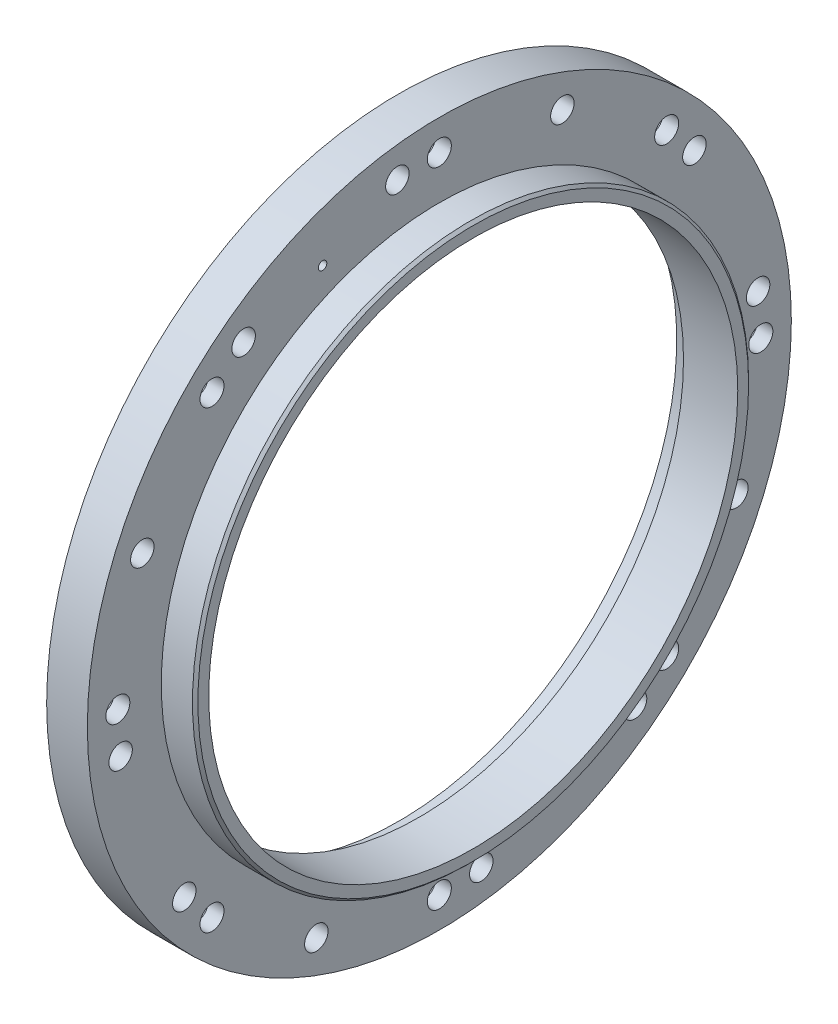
ISO-10303-21;
HEADER;
FILE_DESCRIPTION(('STEP AP214'),'2;1');
FILE_NAME('part.step','',(''),(''),'','','');
FILE_SCHEMA(('AUTOMOTIVE_DESIGN { 1 0 10303 214 1 1 1 1 }'));
ENDSEC;
DATA;
#1=APPLICATION_CONTEXT('core data for automotive mechanical design processes');
#2=APPLICATION_PROTOCOL_DEFINITION('international standard','automotive_design',2000,#1);
#3=PRODUCT_CONTEXT('',#1,'mechanical');
#4=PRODUCT('Part','Part','',(#3));
#5=PRODUCT_RELATED_PRODUCT_CATEGORY('part','',(#4));
#6=PRODUCT_DEFINITION_FORMATION('','',#4);
#7=PRODUCT_DEFINITION_CONTEXT('part definition',#1,'design');
#8=PRODUCT_DEFINITION('design','',#6,#7);
#9=PRODUCT_DEFINITION_SHAPE('','',#8);
#10=(LENGTH_UNIT() NAMED_UNIT(*) SI_UNIT(.MILLI.,.METRE.));
#11=(NAMED_UNIT(*) PLANE_ANGLE_UNIT() SI_UNIT($,.RADIAN.));
#12=(NAMED_UNIT(*) SI_UNIT($,.STERADIAN.) SOLID_ANGLE_UNIT());
#13=UNCERTAINTY_MEASURE_WITH_UNIT(LENGTH_MEASURE(1.E-05),#10,'distance_accuracy_value','');
#14=(GEOMETRIC_REPRESENTATION_CONTEXT(3) GLOBAL_UNCERTAINTY_ASSIGNED_CONTEXT((#13)) GLOBAL_UNIT_ASSIGNED_CONTEXT((#10,
#11,#12)) REPRESENTATION_CONTEXT('',''));
#15=CARTESIAN_POINT('',(0.,0.,0.));
#16=DIRECTION('',(0.,0.,1.));
#17=DIRECTION('',(1.,0.,0.));
#18=AXIS2_PLACEMENT_3D('',#15,#16,#17);
#19=CARTESIAN_POINT('',(0.,0.,0.));
#20=DIRECTION('',(1.,0.,0.));
#21=DIRECTION('',(0.,0.,-1.));
#22=AXIS2_PLACEMENT_3D('',#19,#20,#21);
#23=CYLINDRICAL_SURFACE('',#22,49.53);
#24=CARTESIAN_POINT('',(13.97,0.,0.));
#25=DIRECTION('',(1.,0.,0.));
#26=DIRECTION('',(0.,0.,-1.));
#27=AXIS2_PLACEMENT_3D('',#24,#25,#26);
#28=CIRCLE('',#27,49.53);
#29=CARTESIAN_POINT('',(13.97,0.,-49.53));
#30=VERTEX_POINT('',#29);
#31=EDGE_CURVE('E53',#30,#30,#28,.T.);
#32=CARTESIAN_POINT('',(3.81,0.,0.));
#33=DIRECTION('',(-1.,0.,0.));
#34=DIRECTION('',(0.,0.,1.));
#35=AXIS2_PLACEMENT_3D('',#32,#33,#34);
#36=CIRCLE('',#35,49.53);
#37=CARTESIAN_POINT('',(3.81,0.,-49.53));
#38=VERTEX_POINT('',#37);
#39=EDGE_CURVE('E51',#38,#38,#36,.F.);
#40=CARTESIAN_POINT('',(13.97,0.,-49.53));
#41=CARTESIAN_POINT('',(13.8641666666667,0.,-49.53));
#42=CARTESIAN_POINT('',(13.7583333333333,0.,-49.53));
#43=CARTESIAN_POINT('',(13.5466666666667,0.,-49.53));
#44=CARTESIAN_POINT('',(13.4408333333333,0.,-49.53));
#45=CARTESIAN_POINT('',(13.2291666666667,0.,-49.53));
#46=CARTESIAN_POINT('',(13.1233333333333,0.,-49.53));
#47=CARTESIAN_POINT('',(12.9116666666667,0.,-49.53));
#48=CARTESIAN_POINT('',(12.8058333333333,0.,-49.53));
#49=CARTESIAN_POINT('',(12.5941666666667,0.,-49.53));
#50=CARTESIAN_POINT('',(12.4883333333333,0.,-49.53));
#51=CARTESIAN_POINT('',(12.2766666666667,0.,-49.53));
#52=CARTESIAN_POINT('',(12.1708333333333,0.,-49.53));
#53=CARTESIAN_POINT('',(11.9591666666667,0.,-49.53));
#54=CARTESIAN_POINT('',(11.8533333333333,0.,-49.53));
#55=CARTESIAN_POINT('',(11.6416666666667,0.,-49.53));
#56=CARTESIAN_POINT('',(11.5358333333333,0.,-49.53));
#57=CARTESIAN_POINT('',(11.3241666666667,0.,-49.53));
#58=CARTESIAN_POINT('',(11.2183333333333,0.,-49.53));
#59=CARTESIAN_POINT('',(11.0066666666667,0.,-49.53));
#60=CARTESIAN_POINT('',(10.9008333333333,0.,-49.53));
#61=CARTESIAN_POINT('',(10.6891666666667,0.,-49.53));
#62=CARTESIAN_POINT('',(10.5833333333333,0.,-49.53));
#63=CARTESIAN_POINT('',(10.3716666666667,0.,-49.53));
#64=CARTESIAN_POINT('',(10.2658333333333,0.,-49.53));
#65=CARTESIAN_POINT('',(10.0541666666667,0.,-49.53));
#66=CARTESIAN_POINT('',(9.94833333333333,0.,-49.53));
#67=CARTESIAN_POINT('',(9.73666666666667,0.,-49.53));
#68=CARTESIAN_POINT('',(9.63083333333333,0.,-49.53));
#69=CARTESIAN_POINT('',(9.41916666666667,0.,-49.53));
#70=CARTESIAN_POINT('',(9.31333333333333,0.,-49.53));
#71=CARTESIAN_POINT('',(9.10166666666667,0.,-49.53));
#72=CARTESIAN_POINT('',(8.99583333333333,0.,-49.53));
#73=CARTESIAN_POINT('',(8.78416666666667,0.,-49.53));
#74=CARTESIAN_POINT('',(8.67833333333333,0.,-49.53));
#75=CARTESIAN_POINT('',(8.46666666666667,0.,-49.53));
#76=CARTESIAN_POINT('',(8.36083333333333,0.,-49.53));
#77=CARTESIAN_POINT('',(8.14916666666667,0.,-49.53));
#78=CARTESIAN_POINT('',(8.04333333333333,0.,-49.53));
#79=CARTESIAN_POINT('',(7.83166666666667,0.,-49.53));
#80=CARTESIAN_POINT('',(7.72583333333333,0.,-49.53));
#81=CARTESIAN_POINT('',(7.51416666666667,0.,-49.53));
#82=CARTESIAN_POINT('',(7.40833333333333,0.,-49.53));
#83=CARTESIAN_POINT('',(7.19666666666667,0.,-49.53));
#84=CARTESIAN_POINT('',(7.09083333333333,0.,-49.53));
#85=CARTESIAN_POINT('',(6.87916666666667,0.,-49.53));
#86=CARTESIAN_POINT('',(6.77333333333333,0.,-49.53));
#87=CARTESIAN_POINT('',(6.56166666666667,0.,-49.53));
#88=CARTESIAN_POINT('',(6.45583333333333,0.,-49.53));
#89=CARTESIAN_POINT('',(6.24416666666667,0.,-49.53));
#90=CARTESIAN_POINT('',(6.13833333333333,0.,-49.53));
#91=CARTESIAN_POINT('',(5.92666666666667,0.,-49.53));
#92=CARTESIAN_POINT('',(5.82083333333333,0.,-49.53));
#93=CARTESIAN_POINT('',(5.60916666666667,0.,-49.53));
#94=CARTESIAN_POINT('',(5.50333333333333,0.,-49.53));
#95=CARTESIAN_POINT('',(5.29166666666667,0.,-49.53));
#96=CARTESIAN_POINT('',(5.18583333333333,0.,-49.53));
#97=CARTESIAN_POINT('',(4.97416666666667,0.,-49.53));
#98=CARTESIAN_POINT('',(4.86833333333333,0.,-49.53));
#99=CARTESIAN_POINT('',(4.65666666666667,0.,-49.53));
#100=CARTESIAN_POINT('',(4.55083333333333,0.,-49.53));
#101=CARTESIAN_POINT('',(4.33916666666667,0.,-49.53));
#102=CARTESIAN_POINT('',(4.23333333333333,0.,-49.53));
#103=CARTESIAN_POINT('',(4.02166666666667,0.,-49.53));
#104=CARTESIAN_POINT('',(3.91583333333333,0.,-49.53));
#105=CARTESIAN_POINT('',(3.81,0.,-49.53));
#106=B_SPLINE_CURVE_WITH_KNOTS('',3,(#40,#41,#42,#43,#44,#45,#46,#47,#48,#49,#50,#51,#52,#53,
#54,#55,#56,#57,#58,#59,#60,#61,#62,#63,#64,#65,#66,#67,#68,#69,#70,#71,#72,#73,#74,#75,#76,#77,
#78,#79,#80,#81,#82,#83,#84,#85,#86,#87,#88,#89,#90,#91,#92,#93,#94,#95,#96,#97,#98,#99,#100,
#101,#102,#103,#104,#105),.UNSPECIFIED.,.F.,.F.,(4,2,2,2,2,2,2,2,2,2,2,2,2,2,2,2,2,2,2,2,2,2,2,
2,2,2,2,2,2,2,2,2,4),(0.,0.3175,0.635,0.9525,1.27,1.5875,1.905,2.2225,2.54,2.8575,3.175,3.4925,
3.81,4.1275,4.445,4.7625,5.08,5.3975,5.715,6.0325,6.35,6.6675,6.985,7.3025,7.62,7.9375,8.255,
8.5725,8.89,9.2075,9.525,9.8425,10.16),.UNSPECIFIED.);
#107=EDGE_CURVE('BSEAM34',#30,#38,#106,.T.);
#108=ORIENTED_EDGE('',*,*,#31,.T.);
#109=ORIENTED_EDGE('',*,*,#39,.F.);
#110=ORIENTED_EDGE('',*,*,#107,.T.);
#111=ORIENTED_EDGE('',*,*,#107,.F.);
#112=EDGE_LOOP('',(#108,#110,#109,#111));
#113=FACE_BOUND('',#112,.T.);
#114=ADVANCED_FACE('F34',(#113),#23,.F.);
#115=CARTESIAN_POINT('',(0.,0.,0.));
#116=DIRECTION('',(1.,0.,0.));
#117=DIRECTION('',(0.,0.,-1.));
#118=AXIS2_PLACEMENT_3D('',#115,#116,#117);
#119=PLANE('',#118);
#120=CARTESIAN_POINT('',(0.,52.7997152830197,21.8703581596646));
#121=DIRECTION('',(-1.,0.,0.));
#122=DIRECTION('',(0.,0.,1.));
#123=AXIS2_PLACEMENT_3D('',#120,#121,#122);
#124=CIRCLE('',#123,0.793749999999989);
#125=CARTESIAN_POINT('',(0.,52.7997152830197,22.6641081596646));
#126=VERTEX_POINT('',#125);
#127=EDGE_CURVE('E68',#126,#126,#124,.T.);
#128=ORIENTED_EDGE('',*,*,#127,.F.);
#129=EDGE_LOOP('',(#128));
#130=FACE_BOUND('',#129,.T.);
#131=CARTESIAN_POINT('',(0.,-52.79971528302,-21.870358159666));
#132=DIRECTION('',(-1.,0.,0.));
#133=DIRECTION('',(0.,0.,1.));
#134=AXIS2_PLACEMENT_3D('',#131,#132,#133);
#135=CIRCLE('',#134,0.793749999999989);
#136=CARTESIAN_POINT('',(0.,-52.79971528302,-21.076608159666));
#137=VERTEX_POINT('',#136);
#138=EDGE_CURVE('E58',#137,#137,#135,.T.);
#139=ORIENTED_EDGE('',*,*,#138,.F.);
#140=EDGE_LOOP('',(#139));
#141=FACE_BOUND('',#140,.T.);
#142=CARTESIAN_POINT('',(0.,0.,0.));
#143=DIRECTION('',(-1.,0.,0.));
#144=DIRECTION('',(0.,0.,1.));
#145=AXIS2_PLACEMENT_3D('',#142,#143,#144);
#146=CIRCLE('',#145,52.07);
#147=CARTESIAN_POINT('',(0.,0.,52.07));
#148=VERTEX_POINT('',#147);
#149=EDGE_CURVE('E57',#148,#148,#146,.T.);
#150=ORIENTED_EDGE('',*,*,#149,.F.);
#151=EDGE_LOOP('',(#150));
#152=FACE_BOUND('',#151,.T.);
#153=CARTESIAN_POINT('',(0.,7.85741571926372,-59.6829977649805));
#154=DIRECTION('',(-1.,0.,0.));
#155=DIRECTION('',(0.,0.,1.));
#156=AXIS2_PLACEMENT_3D('',#153,#154,#155);
#157=CIRCLE('',#156,2.1971);
#158=CARTESIAN_POINT('',(0.,7.85741571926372,-57.4858977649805));
#159=VERTEX_POINT('',#158);
#160=EDGE_CURVE('E82',#159,#159,#157,.T.);
#161=ORIENTED_EDGE('',*,*,#160,.F.);
#162=EDGE_LOOP('',(#161));
#163=FACE_BOUND('',#162,.T.);
#164=CARTESIAN_POINT('',(0.,-23.0367772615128,-55.6157000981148));
#165=DIRECTION('',(-1.,0.,0.));
#166=DIRECTION('',(0.,0.,1.));
#167=AXIS2_PLACEMENT_3D('',#164,#165,#166);
#168=CIRCLE('',#167,2.1971);
#169=CARTESIAN_POINT('',(0.,-23.0367772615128,-53.4186000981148));
#170=VERTEX_POINT('',#169);
#171=EDGE_CURVE('E88',#170,#170,#168,.T.);
#172=ORIENTED_EDGE('',*,*,#171,.F.);
#173=EDGE_LOOP('',(#172));
#174=FACE_BOUND('',#173,.T.);
#175=CARTESIAN_POINT('',(0.,-59.6829977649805,-7.85741571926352));
#176=DIRECTION('',(-1.,0.,0.));
#177=DIRECTION('',(0.,0.,1.));
#178=AXIS2_PLACEMENT_3D('',#175,#176,#177);
#179=CIRCLE('',#178,2.19709999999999);
#180=CARTESIAN_POINT('',(0.,-59.6829977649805,-5.66031571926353));
#181=VERTEX_POINT('',#180);
#182=EDGE_CURVE('E98',#181,#181,#179,.T.);
#183=ORIENTED_EDGE('',*,*,#182,.F.);
#184=EDGE_LOOP('',(#183));
#185=FACE_BOUND('',#184,.T.);
#186=CARTESIAN_POINT('',(0.,-7.85741571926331,59.6829977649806));
#187=DIRECTION('',(-1.,0.,0.));
#188=DIRECTION('',(0.,0.,1.));
#189=AXIS2_PLACEMENT_3D('',#186,#187,#188);
#190=CIRCLE('',#189,2.1971);
#191=CARTESIAN_POINT('',(0.,-7.85741571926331,61.8800977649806));
#192=VERTEX_POINT('',#191);
#193=EDGE_CURVE('E114',#192,#192,#190,.T.);
#194=ORIENTED_EDGE('',*,*,#193,.F.);
#195=EDGE_LOOP('',(#194));
#196=FACE_BOUND('',#195,.T.);
#197=CARTESIAN_POINT('',(0.,23.0367772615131,55.6157000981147));
#198=DIRECTION('',(-1.,0.,0.));
#199=DIRECTION('',(0.,0.,1.));
#200=AXIS2_PLACEMENT_3D('',#197,#198,#199);
#201=CIRCLE('',#200,2.1971);
#202=CARTESIAN_POINT('',(0.,23.0367772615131,57.8128000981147));
#203=VERTEX_POINT('',#202);
#204=EDGE_CURVE('E120',#203,#203,#201,.T.);
#205=ORIENTED_EDGE('',*,*,#204,.F.);
#206=EDGE_LOOP('',(#205));
#207=FACE_BOUND('',#206,.T.);
#208=CARTESIAN_POINT('',(0.,47.7582843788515,36.6462205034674));
#209=DIRECTION('',(-1.,0.,0.));
#210=DIRECTION('',(0.,0.,1.));
#211=AXIS2_PLACEMENT_3D('',#208,#209,#210);
#212=CIRCLE('',#211,2.19709999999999);
#213=CARTESIAN_POINT('',(0.,47.7582843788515,38.8433205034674));
#214=VERTEX_POINT('',#213);
#215=EDGE_CURVE('E126',#214,#214,#212,.T.);
#216=ORIENTED_EDGE('',*,*,#215,.F.);
#217=EDGE_LOOP('',(#216));
#218=FACE_BOUND('',#217,.T.);
#219=CARTESIAN_POINT('',(0.,59.6829977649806,7.8574157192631));
#220=DIRECTION('',(-1.,0.,0.));
#221=DIRECTION('',(0.,0.,1.));
#222=AXIS2_PLACEMENT_3D('',#219,#220,#221);
#223=CIRCLE('',#222,2.19709999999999);
#224=CARTESIAN_POINT('',(0.,59.6829977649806,10.0545157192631));
#225=VERTEX_POINT('',#224);
#226=EDGE_CURVE('E132',#225,#225,#223,.T.);
#227=ORIENTED_EDGE('',*,*,#226,.F.);
#228=EDGE_LOOP('',(#227));
#229=FACE_BOUND('',#228,.T.);
#230=CARTESIAN_POINT('',(0.,55.6157000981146,-23.0367772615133));
#231=DIRECTION('',(-1.,0.,0.));
#232=DIRECTION('',(0.,0.,1.));
#233=AXIS2_PLACEMENT_3D('',#230,#231,#232);
#234=CIRCLE('',#233,2.19709999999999);
#235=CARTESIAN_POINT('',(0.,55.6157000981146,-20.8396772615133));
#236=VERTEX_POINT('',#235);
#237=EDGE_CURVE('E138',#236,#236,#234,.T.);
#238=ORIENTED_EDGE('',*,*,#237,.F.);
#239=EDGE_LOOP('',(#238));
#240=FACE_BOUND('',#239,.T.);
#241=CARTESIAN_POINT('',(0.,42.5664140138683,-42.5664140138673));
#242=DIRECTION('',(-1.,0.,0.));
#243=DIRECTION('',(0.,0.,1.));
#244=AXIS2_PLACEMENT_3D('',#241,#242,#243);
#245=CIRCLE('',#244,4.2164);
#246=CARTESIAN_POINT('',(0.,42.5664140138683,-38.3500140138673));
#247=VERTEX_POINT('',#246);
#248=EDGE_CURVE('E144',#247,#247,#245,.T.);
#249=ORIENTED_EDGE('',*,*,#248,.F.);
#250=EDGE_LOOP('',(#249));
#251=FACE_BOUND('',#250,.T.);
#252=CARTESIAN_POINT('',(0.,6.30540580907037E-13,-60.198));
#253=DIRECTION('',(-1.,0.,0.));
#254=DIRECTION('',(0.,0.,1.));
#255=AXIS2_PLACEMENT_3D('',#252,#253,#254);
#256=CIRCLE('',#255,4.2164);
#257=CARTESIAN_POINT('',(0.,6.30540580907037E-13,-55.9816));
#258=VERTEX_POINT('',#257);
#259=EDGE_CURVE('E159',#258,#258,#256,.T.);
#260=ORIENTED_EDGE('',*,*,#259,.F.);
#261=EDGE_LOOP('',(#260));
#262=FACE_BOUND('',#261,.T.);
#263=CARTESIAN_POINT('',(0.,-42.5664140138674,-42.5664140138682));
#264=DIRECTION('',(-1.,0.,0.));
#265=DIRECTION('',(0.,0.,1.));
#266=AXIS2_PLACEMENT_3D('',#263,#264,#265);
#267=CIRCLE('',#266,4.2164);
#268=CARTESIAN_POINT('',(0.,-42.5664140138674,-38.3500140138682));
#269=VERTEX_POINT('',#268);
#270=EDGE_CURVE('E174',#269,#269,#267,.T.);
#271=ORIENTED_EDGE('',*,*,#270,.F.);
#272=EDGE_LOOP('',(#271));
#273=FACE_BOUND('',#272,.T.);
#274=CARTESIAN_POINT('',(0.,-60.198,0.));
#275=DIRECTION('',(-1.,0.,0.));
#276=DIRECTION('',(0.,0.,1.));
#277=AXIS2_PLACEMENT_3D('',#274,#275,#276);
#278=CIRCLE('',#277,4.2164);
#279=CARTESIAN_POINT('',(0.,-60.198,4.2164));
#280=VERTEX_POINT('',#279);
#281=EDGE_CURVE('E189',#280,#280,#278,.T.);
#282=ORIENTED_EDGE('',*,*,#281,.F.);
#283=EDGE_LOOP('',(#282));
#284=FACE_BOUND('',#283,.T.);
#285=CARTESIAN_POINT('',(0.,-42.566414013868,42.5664140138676));
#286=DIRECTION('',(-1.,0.,0.));
#287=DIRECTION('',(0.,0.,1.));
#288=AXIS2_PLACEMENT_3D('',#285,#286,#287);
#289=CIRCLE('',#288,4.2164);
#290=CARTESIAN_POINT('',(0.,-42.566414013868,46.7828140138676));
#291=VERTEX_POINT('',#290);
#292=EDGE_CURVE('E204',#291,#291,#289,.T.);
#293=ORIENTED_EDGE('',*,*,#292,.F.);
#294=EDGE_LOOP('',(#293));
#295=FACE_BOUND('',#294,.T.);
#296=CARTESIAN_POINT('',(0.,-2.10180193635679E-13,60.198));
#297=DIRECTION('',(-1.,0.,0.));
#298=DIRECTION('',(0.,0.,1.));
#299=AXIS2_PLACEMENT_3D('',#296,#297,#298);
#300=CIRCLE('',#299,4.2164);
#301=CARTESIAN_POINT('',(0.,-2.10180193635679E-13,64.4144));
#302=VERTEX_POINT('',#301);
#303=EDGE_CURVE('E219',#302,#302,#300,.T.);
#304=ORIENTED_EDGE('',*,*,#303,.F.);
#305=EDGE_LOOP('',(#304));
#306=FACE_BOUND('',#305,.T.);
#307=CARTESIAN_POINT('',(0.,42.5664140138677,42.5664140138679));
#308=DIRECTION('',(-1.,0.,0.));
#309=DIRECTION('',(0.,0.,1.));
#310=AXIS2_PLACEMENT_3D('',#307,#308,#309);
#311=CIRCLE('',#310,4.2164);
#312=CARTESIAN_POINT('',(0.,42.5664140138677,46.7828140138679));
#313=VERTEX_POINT('',#312);
#314=EDGE_CURVE('E234',#313,#313,#311,.T.);
#315=ORIENTED_EDGE('',*,*,#314,.F.);
#316=EDGE_LOOP('',(#315));
#317=FACE_BOUND('',#316,.T.);
#318=CARTESIAN_POINT('',(0.,60.198,0.));
#319=DIRECTION('',(-1.,0.,0.));
#320=DIRECTION('',(0.,0.,1.));
#321=AXIS2_PLACEMENT_3D('',#318,#319,#320);
#322=CIRCLE('',#321,4.21640000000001);
#323=CARTESIAN_POINT('',(0.,60.198,4.21640000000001));
#324=VERTEX_POINT('',#323);
#325=EDGE_CURVE('E249',#324,#324,#322,.T.);
#326=ORIENTED_EDGE('',*,*,#325,.F.);
#327=EDGE_LOOP('',(#326));
#328=FACE_BOUND('',#327,.T.);
#329=CARTESIAN_POINT('',(0.,0.,0.));
#330=DIRECTION('',(1.,0.,0.));
#331=DIRECTION('',(0.,0.,-1.));
#332=AXIS2_PLACEMENT_3D('',#329,#330,#331);
#333=CIRCLE('',#332,65.913);
#334=CARTESIAN_POINT('',(0.,0.,65.913));
#335=VERTEX_POINT('',#334);
#336=EDGE_CURVE('E264',#335,#335,#333,.T.);
#337=ORIENTED_EDGE('',*,*,#336,.F.);
#338=EDGE_LOOP('',(#337));
#339=FACE_BOUND('',#338,.T.);
#340=CARTESIAN_POINT('',(0.,-36.6462205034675,47.7582843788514));
#341=DIRECTION('',(-1.,0.,0.));
#342=DIRECTION('',(0.,0.,1.));
#343=AXIS2_PLACEMENT_3D('',#340,#341,#342);
#344=CIRCLE('',#343,2.19709999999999);
#345=CARTESIAN_POINT('',(0.,-36.6462205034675,49.9553843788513));
#346=VERTEX_POINT('',#345);
#347=EDGE_CURVE('E108',#346,#346,#344,.T.);
#348=ORIENTED_EDGE('',*,*,#347,.F.);
#349=EDGE_LOOP('',(#348));
#350=FACE_BOUND('',#349,.T.);
#351=CARTESIAN_POINT('',(0.,-55.6157000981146,23.0367772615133));
#352=DIRECTION('',(-1.,0.,0.));
#353=DIRECTION('',(0.,0.,1.));
#354=AXIS2_PLACEMENT_3D('',#351,#352,#353);
#355=CIRCLE('',#354,2.19709999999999);
#356=CARTESIAN_POINT('',(0.,-55.6157000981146,25.2338772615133));
#357=VERTEX_POINT('',#356);
#358=EDGE_CURVE('E104',#357,#357,#355,.T.);
#359=ORIENTED_EDGE('',*,*,#358,.F.);
#360=EDGE_LOOP('',(#359));
#361=FACE_BOUND('',#360,.T.);
#362=CARTESIAN_POINT('',(0.,-47.7582843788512,-36.6462205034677));
#363=DIRECTION('',(-1.,0.,0.));
#364=DIRECTION('',(0.,0.,1.));
#365=AXIS2_PLACEMENT_3D('',#362,#363,#364);
#366=CIRCLE('',#365,2.19709999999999);
#367=CARTESIAN_POINT('',(0.,-47.7582843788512,-34.4491205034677));
#368=VERTEX_POINT('',#367);
#369=EDGE_CURVE('E92',#368,#368,#366,.T.);
#370=ORIENTED_EDGE('',*,*,#369,.F.);
#371=EDGE_LOOP('',(#370));
#372=FACE_BOUND('',#371,.T.);
#373=CARTESIAN_POINT('',(0.,36.6462205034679,-47.7582843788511));
#374=DIRECTION('',(-1.,0.,0.));
#375=DIRECTION('',(0.,0.,1.));
#376=AXIS2_PLACEMENT_3D('',#373,#374,#375);
#377=CIRCLE('',#376,2.19709999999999);
#378=CARTESIAN_POINT('',(0.,36.6462205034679,-45.5611843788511));
#379=VERTEX_POINT('',#378);
#380=EDGE_CURVE('E78',#379,#379,#377,.T.);
#381=ORIENTED_EDGE('',*,*,#380,.F.);
#382=EDGE_LOOP('',(#381));
#383=FACE_BOUND('',#382,.T.);
#384=ADVANCED_FACE('F327',(#130,#141,#152,#163,#174,#185,#196,#207,#218,#229,#240,#251,#262,
#273,#284,#295,#306,#317,#328,#339,#350,#361,#372,#383),#119,.F.);
#385=CARTESIAN_POINT('',(7.62,0.,0.));
#386=DIRECTION('',(-1.,0.,0.));
#387=DIRECTION('',(0.,0.,1.));
#388=AXIS2_PLACEMENT_3D('',#385,#386,#387);
#389=CYLINDRICAL_SURFACE('',#388,65.913);
#390=CARTESIAN_POINT('',(7.62,0.,0.));
#391=DIRECTION('',(1.,0.,0.));
#392=DIRECTION('',(0.,0.,-1.));
#393=AXIS2_PLACEMENT_3D('',#390,#391,#392);
#394=CIRCLE('',#393,65.913);
#395=CARTESIAN_POINT('',(7.62,0.,65.913));
#396=VERTEX_POINT('',#395);
#397=EDGE_CURVE('E47',#396,#396,#394,.T.);
#398=CARTESIAN_POINT('',(7.62,0.,65.913));
#399=CARTESIAN_POINT('',(7.540625,0.,65.913));
#400=CARTESIAN_POINT('',(7.46125,0.,65.913));
#401=CARTESIAN_POINT('',(7.3025,0.,65.913));
#402=CARTESIAN_POINT('',(7.223125,0.,65.913));
#403=CARTESIAN_POINT('',(7.064375,0.,65.913));
#404=CARTESIAN_POINT('',(6.985,0.,65.913));
#405=CARTESIAN_POINT('',(6.82625,0.,65.913));
#406=CARTESIAN_POINT('',(6.746875,0.,65.913));
#407=CARTESIAN_POINT('',(6.588125,0.,65.913));
#408=CARTESIAN_POINT('',(6.50875,0.,65.913));
#409=CARTESIAN_POINT('',(6.35,0.,65.913));
#410=CARTESIAN_POINT('',(6.270625,0.,65.913));
#411=CARTESIAN_POINT('',(6.111875,0.,65.913));
#412=CARTESIAN_POINT('',(6.0325,0.,65.913));
#413=CARTESIAN_POINT('',(5.87375,0.,65.913));
#414=CARTESIAN_POINT('',(5.794375,0.,65.913));
#415=CARTESIAN_POINT('',(5.635625,0.,65.913));
#416=CARTESIAN_POINT('',(5.55625,0.,65.913));
#417=CARTESIAN_POINT('',(5.3975,0.,65.913));
#418=CARTESIAN_POINT('',(5.318125,0.,65.913));
#419=CARTESIAN_POINT('',(5.159375,0.,65.913));
#420=CARTESIAN_POINT('',(5.08,0.,65.913));
#421=CARTESIAN_POINT('',(4.92125,0.,65.913));
#422=CARTESIAN_POINT('',(4.841875,0.,65.913));
#423=CARTESIAN_POINT('',(4.683125,0.,65.913));
#424=CARTESIAN_POINT('',(4.60375,0.,65.913));
#425=CARTESIAN_POINT('',(4.445,0.,65.913));
#426=CARTESIAN_POINT('',(4.365625,0.,65.913));
#427=CARTESIAN_POINT('',(4.206875,0.,65.913));
#428=CARTESIAN_POINT('',(4.1275,0.,65.913));
#429=CARTESIAN_POINT('',(3.96875,0.,65.913));
#430=CARTESIAN_POINT('',(3.889375,0.,65.913));
#431=CARTESIAN_POINT('',(3.730625,0.,65.913));
#432=CARTESIAN_POINT('',(3.65125,0.,65.913));
#433=CARTESIAN_POINT('',(3.4925,0.,65.913));
#434=CARTESIAN_POINT('',(3.413125,0.,65.913));
#435=CARTESIAN_POINT('',(3.254375,0.,65.913));
#436=CARTESIAN_POINT('',(3.175,0.,65.913));
#437=CARTESIAN_POINT('',(3.01625,0.,65.913));
#438=CARTESIAN_POINT('',(2.936875,0.,65.913));
#439=CARTESIAN_POINT('',(2.778125,0.,65.913));
#440=CARTESIAN_POINT('',(2.69875,0.,65.913));
#441=CARTESIAN_POINT('',(2.54,0.,65.913));
#442=CARTESIAN_POINT('',(2.460625,0.,65.913));
#443=CARTESIAN_POINT('',(2.301875,0.,65.913));
#444=CARTESIAN_POINT('',(2.2225,0.,65.913));
#445=CARTESIAN_POINT('',(2.06375,0.,65.913));
#446=CARTESIAN_POINT('',(1.984375,0.,65.913));
#447=CARTESIAN_POINT('',(1.825625,0.,65.913));
#448=CARTESIAN_POINT('',(1.74625,0.,65.913));
#449=CARTESIAN_POINT('',(1.5875,0.,65.913));
#450=CARTESIAN_POINT('',(1.508125,0.,65.913));
#451=CARTESIAN_POINT('',(1.349375,0.,65.913));
#452=CARTESIAN_POINT('',(1.27,0.,65.913));
#453=CARTESIAN_POINT('',(1.11125,0.,65.913));
#454=CARTESIAN_POINT('',(1.031875,0.,65.913));
#455=CARTESIAN_POINT('',(0.873125,0.,65.913));
#456=CARTESIAN_POINT('',(0.79375,0.,65.913));
#457=CARTESIAN_POINT('',(0.635,0.,65.913));
#458=CARTESIAN_POINT('',(0.555625,0.,65.913));
#459=CARTESIAN_POINT('',(0.396875,0.,65.913));
#460=CARTESIAN_POINT('',(0.3175,0.,65.913));
#461=CARTESIAN_POINT('',(0.15875,0.,65.913));
#462=CARTESIAN_POINT('',(0.0793749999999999,0.,65.913));
#463=CARTESIAN_POINT('',(0.,0.,65.913));
#464=B_SPLINE_CURVE_WITH_KNOTS('',3,(#398,#399,#400,#401,#402,#403,#404,#405,#406,#407,#408,
#409,#410,#411,#412,#413,#414,#415,#416,#417,#418,#419,#420,#421,#422,#423,#424,#425,#426,#427,
#428,#429,#430,#431,#432,#433,#434,#435,#436,#437,#438,#439,#440,#441,#442,#443,#444,#445,#446,
#447,#448,#449,#450,#451,#452,#453,#454,#455,#456,#457,#458,#459,#460,#461,#462,#463),
.UNSPECIFIED.,.F.,.F.,(4,2,2,2,2,2,2,2,2,2,2,2,2,2,2,2,2,2,2,2,2,2,2,2,2,2,2,2,2,2,2,2,4),(0.,
0.238125,0.476249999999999,0.714375,0.952499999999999,1.190625,1.42875,1.666875,1.905,2.143125,
2.38125,2.619375,2.8575,3.095625,3.33375,3.571875,3.81,4.048125,4.28625,4.524375,4.7625,
5.000625,5.23875,5.476875,5.715,5.953125,6.19125,6.429375,6.6675,6.905625,7.14375,7.381875,
7.62),.UNSPECIFIED.);
#465=EDGE_CURVE('BSEAM282',#396,#335,#464,.T.);
#466=ORIENTED_EDGE('',*,*,#397,.F.);
#467=ORIENTED_EDGE('',*,*,#336,.T.);
#468=ORIENTED_EDGE('',*,*,#465,.T.);
#469=ORIENTED_EDGE('',*,*,#465,.F.);
#470=EDGE_LOOP('',(#466,#468,#467,#469));
#471=FACE_BOUND('',#470,.T.);
#472=ADVANCED_FACE('F282',(#471),#389,.T.);
#473=CARTESIAN_POINT('',(7.62,0.,0.));
#474=DIRECTION('',(1.,0.,0.));
#475=DIRECTION('',(0.,0.,-1.));
#476=AXIS2_PLACEMENT_3D('',#473,#474,#475);
#477=PLANE('',#476);
#478=CARTESIAN_POINT('',(7.62,52.7997152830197,21.8703581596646));
#479=DIRECTION('',(1.,0.,0.));
#480=DIRECTION('',(0.,0.,-1.));
#481=AXIS2_PLACEMENT_3D('',#478,#479,#480);
#482=CIRCLE('',#481,0.793749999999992);
#483=CARTESIAN_POINT('',(7.62,52.7997152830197,21.0766081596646));
#484=VERTEX_POINT('',#483);
#485=EDGE_CURVE('E38',#484,#484,#482,.T.);
#486=ORIENTED_EDGE('',*,*,#485,.F.);
#487=EDGE_LOOP('',(#486));
#488=FACE_BOUND('',#487,.T.);
#489=CARTESIAN_POINT('',(7.62,-52.79971528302,-21.870358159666));
#490=DIRECTION('',(1.,0.,0.));
#491=DIRECTION('',(0.,0.,-1.));
#492=AXIS2_PLACEMENT_3D('',#489,#490,#491);
#493=CIRCLE('',#492,0.793749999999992);
#494=CARTESIAN_POINT('',(7.62,-52.79971528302,-22.664108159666));
#495=VERTEX_POINT('',#494);
#496=EDGE_CURVE('E55',#495,#495,#493,.T.);
#497=ORIENTED_EDGE('',*,*,#496,.F.);
#498=EDGE_LOOP('',(#497));
#499=FACE_BOUND('',#498,.T.);
#500=CARTESIAN_POINT('',(7.62,0.,0.));
#501=DIRECTION('',(1.,0.,0.));
#502=DIRECTION('',(0.,0.,-1.));
#503=AXIS2_PLACEMENT_3D('',#500,#501,#502);
#504=CIRCLE('',#503,52.07);
#505=CARTESIAN_POINT('',(7.62,0.,-52.07));
#506=VERTEX_POINT('',#505);
#507=EDGE_CURVE('E75',#506,#506,#504,.T.);
#508=ORIENTED_EDGE('',*,*,#507,.F.);
#509=EDGE_LOOP('',(#508));
#510=FACE_BOUND('',#509,.T.);
#511=CARTESIAN_POINT('',(7.62,36.6462205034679,-47.7582843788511));
#512=DIRECTION('',(1.,0.,0.));
#513=DIRECTION('',(0.,0.,-1.));
#514=AXIS2_PLACEMENT_3D('',#511,#512,#513);
#515=CIRCLE('',#514,2.19709999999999);
#516=CARTESIAN_POINT('',(7.62,36.6462205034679,-49.9553843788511));
#517=VERTEX_POINT('',#516);
#518=EDGE_CURVE('E81',#517,#517,#515,.T.);
#519=ORIENTED_EDGE('',*,*,#518,.F.);
#520=EDGE_LOOP('',(#519));
#521=FACE_BOUND('',#520,.T.);
#522=CARTESIAN_POINT('',(7.62,7.85741571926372,-59.6829977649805));
#523=DIRECTION('',(1.,0.,0.));
#524=DIRECTION('',(0.,0.,-1.));
#525=AXIS2_PLACEMENT_3D('',#522,#523,#524);
#526=CIRCLE('',#525,2.1971);
#527=CARTESIAN_POINT('',(7.62,7.85741571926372,-61.8800977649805));
#528=VERTEX_POINT('',#527);
#529=EDGE_CURVE('E85',#528,#528,#526,.T.);
#530=ORIENTED_EDGE('',*,*,#529,.F.);
#531=EDGE_LOOP('',(#530));
#532=FACE_BOUND('',#531,.T.);
#533=CARTESIAN_POINT('',(7.62,-23.0367772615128,-55.6157000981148));
#534=DIRECTION('',(1.,0.,0.));
#535=DIRECTION('',(0.,0.,-1.));
#536=AXIS2_PLACEMENT_3D('',#533,#534,#535);
#537=CIRCLE('',#536,2.1971);
#538=CARTESIAN_POINT('',(7.62,-23.0367772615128,-57.8128000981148));
#539=VERTEX_POINT('',#538);
#540=EDGE_CURVE('E91',#539,#539,#537,.T.);
#541=ORIENTED_EDGE('',*,*,#540,.F.);
#542=EDGE_LOOP('',(#541));
#543=FACE_BOUND('',#542,.T.);
#544=CARTESIAN_POINT('',(7.62,-47.7582843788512,-36.6462205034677));
#545=DIRECTION('',(1.,0.,0.));
#546=DIRECTION('',(0.,0.,-1.));
#547=AXIS2_PLACEMENT_3D('',#544,#545,#546);
#548=CIRCLE('',#547,2.19709999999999);
#549=CARTESIAN_POINT('',(7.62,-47.7582843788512,-38.8433205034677));
#550=VERTEX_POINT('',#549);
#551=EDGE_CURVE('E95',#550,#550,#548,.T.);
#552=ORIENTED_EDGE('',*,*,#551,.F.);
#553=EDGE_LOOP('',(#552));
#554=FACE_BOUND('',#553,.T.);
#555=CARTESIAN_POINT('',(7.62,-59.6829977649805,-7.85741571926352));
#556=DIRECTION('',(1.,0.,0.));
#557=DIRECTION('',(0.,0.,-1.));
#558=AXIS2_PLACEMENT_3D('',#555,#556,#557);
#559=CIRCLE('',#558,2.19709999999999);
#560=CARTESIAN_POINT('',(7.62,-59.6829977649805,-10.0545157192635));
#561=VERTEX_POINT('',#560);
#562=EDGE_CURVE('E101',#561,#561,#559,.T.);
#563=ORIENTED_EDGE('',*,*,#562,.F.);
#564=EDGE_LOOP('',(#563));
#565=FACE_BOUND('',#564,.T.);
#566=CARTESIAN_POINT('',(7.62,-55.6157000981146,23.0367772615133));
#567=DIRECTION('',(1.,0.,0.));
#568=DIRECTION('',(0.,0.,-1.));
#569=AXIS2_PLACEMENT_3D('',#566,#567,#568);
#570=CIRCLE('',#569,2.19709999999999);
#571=CARTESIAN_POINT('',(7.62,-55.6157000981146,20.8396772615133));
#572=VERTEX_POINT('',#571);
#573=EDGE_CURVE('E107',#572,#572,#570,.T.);
#574=ORIENTED_EDGE('',*,*,#573,.F.);
#575=EDGE_LOOP('',(#574));
#576=FACE_BOUND('',#575,.T.);
#577=CARTESIAN_POINT('',(7.62,-36.6462205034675,47.7582843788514));
#578=DIRECTION('',(1.,0.,0.));
#579=DIRECTION('',(0.,0.,-1.));
#580=AXIS2_PLACEMENT_3D('',#577,#578,#579);
#581=CIRCLE('',#580,2.19709999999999);
#582=CARTESIAN_POINT('',(7.62,-36.6462205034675,45.5611843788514));
#583=VERTEX_POINT('',#582);
#584=EDGE_CURVE('E111',#583,#583,#581,.T.);
#585=ORIENTED_EDGE('',*,*,#584,.F.);
#586=EDGE_LOOP('',(#585));
#587=FACE_BOUND('',#586,.T.);
#588=CARTESIAN_POINT('',(7.62,-7.85741571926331,59.6829977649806));
#589=DIRECTION('',(1.,0.,0.));
#590=DIRECTION('',(0.,0.,-1.));
#591=AXIS2_PLACEMENT_3D('',#588,#589,#590);
#592=CIRCLE('',#591,2.1971);
#593=CARTESIAN_POINT('',(7.62,-7.85741571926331,57.4858977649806));
#594=VERTEX_POINT('',#593);
#595=EDGE_CURVE('E117',#594,#594,#592,.T.);
#596=ORIENTED_EDGE('',*,*,#595,.F.);
#597=EDGE_LOOP('',(#596));
#598=FACE_BOUND('',#597,.T.);
#599=CARTESIAN_POINT('',(7.62,23.0367772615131,55.6157000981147));
#600=DIRECTION('',(1.,0.,0.));
#601=DIRECTION('',(0.,0.,-1.));
#602=AXIS2_PLACEMENT_3D('',#599,#600,#601);
#603=CIRCLE('',#602,2.1971);
#604=CARTESIAN_POINT('',(7.62,23.0367772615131,53.4186000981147));
#605=VERTEX_POINT('',#604);
#606=EDGE_CURVE('E123',#605,#605,#603,.T.);
#607=ORIENTED_EDGE('',*,*,#606,.F.);
#608=EDGE_LOOP('',(#607));
#609=FACE_BOUND('',#608,.T.);
#610=CARTESIAN_POINT('',(7.62,47.7582843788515,36.6462205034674));
#611=DIRECTION('',(1.,0.,0.));
#612=DIRECTION('',(0.,0.,-1.));
#613=AXIS2_PLACEMENT_3D('',#610,#611,#612);
#614=CIRCLE('',#613,2.19709999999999);
#615=CARTESIAN_POINT('',(7.62,47.7582843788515,34.4491205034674));
#616=VERTEX_POINT('',#615);
#617=EDGE_CURVE('E129',#616,#616,#614,.T.);
#618=ORIENTED_EDGE('',*,*,#617,.F.);
#619=EDGE_LOOP('',(#618));
#620=FACE_BOUND('',#619,.T.);
#621=CARTESIAN_POINT('',(7.62,59.6829977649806,7.8574157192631));
#622=DIRECTION('',(1.,0.,0.));
#623=DIRECTION('',(0.,0.,-1.));
#624=AXIS2_PLACEMENT_3D('',#621,#622,#623);
#625=CIRCLE('',#624,2.19709999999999);
#626=CARTESIAN_POINT('',(7.62,59.6829977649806,5.66031571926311));
#627=VERTEX_POINT('',#626);
#628=EDGE_CURVE('E135',#627,#627,#625,.T.);
#629=ORIENTED_EDGE('',*,*,#628,.F.);
#630=EDGE_LOOP('',(#629));
#631=FACE_BOUND('',#630,.T.);
#632=CARTESIAN_POINT('',(7.62,55.6157000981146,-23.0367772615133));
#633=DIRECTION('',(1.,0.,0.));
#634=DIRECTION('',(0.,0.,-1.));
#635=AXIS2_PLACEMENT_3D('',#632,#633,#634);
#636=CIRCLE('',#635,2.19709999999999);
#637=CARTESIAN_POINT('',(7.62,55.6157000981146,-25.2338772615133));
#638=VERTEX_POINT('',#637);
#639=EDGE_CURVE('E141',#638,#638,#636,.T.);
#640=ORIENTED_EDGE('',*,*,#639,.F.);
#641=EDGE_LOOP('',(#640));
#642=FACE_BOUND('',#641,.T.);
#643=CARTESIAN_POINT('',(7.62,42.5664140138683,-42.5664140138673));
#644=DIRECTION('',(-1.,0.,0.));
#645=DIRECTION('',(0.,0.,1.));
#646=AXIS2_PLACEMENT_3D('',#643,#644,#645);
#647=CIRCLE('',#646,2.24790000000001);
#648=CARTESIAN_POINT('',(7.62,42.5664140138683,-40.3185140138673));
#649=VERTEX_POINT('',#648);
#650=EDGE_CURVE('E156',#649,#649,#647,.T.);
#651=ORIENTED_EDGE('',*,*,#650,.T.);
#652=EDGE_LOOP('',(#651));
#653=FACE_BOUND('',#652,.T.);
#654=CARTESIAN_POINT('',(7.62,6.30540580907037E-13,-60.198));
#655=DIRECTION('',(-1.,0.,0.));
#656=DIRECTION('',(0.,0.,1.));
#657=AXIS2_PLACEMENT_3D('',#654,#655,#656);
#658=CIRCLE('',#657,2.24790000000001);
#659=CARTESIAN_POINT('',(7.62,6.30540580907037E-13,-57.9501));
#660=VERTEX_POINT('',#659);
#661=EDGE_CURVE('E171',#660,#660,#658,.T.);
#662=ORIENTED_EDGE('',*,*,#661,.T.);
#663=EDGE_LOOP('',(#662));
#664=FACE_BOUND('',#663,.T.);
#665=CARTESIAN_POINT('',(7.62,-42.5664140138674,-42.5664140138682));
#666=DIRECTION('',(-1.,0.,0.));
#667=DIRECTION('',(0.,0.,1.));
#668=AXIS2_PLACEMENT_3D('',#665,#666,#667);
#669=CIRCLE('',#668,2.24790000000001);
#670=CARTESIAN_POINT('',(7.62,-42.5664140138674,-40.3185140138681));
#671=VERTEX_POINT('',#670);
#672=EDGE_CURVE('E186',#671,#671,#669,.T.);
#673=ORIENTED_EDGE('',*,*,#672,.T.);
#674=EDGE_LOOP('',(#673));
#675=FACE_BOUND('',#674,.T.);
#676=CARTESIAN_POINT('',(7.62,-60.198,0.));
#677=DIRECTION('',(-1.,0.,0.));
#678=DIRECTION('',(0.,0.,1.));
#679=AXIS2_PLACEMENT_3D('',#676,#677,#678);
#680=CIRCLE('',#679,2.24790000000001);
#681=CARTESIAN_POINT('',(7.62,-60.198,2.24790000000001));
#682=VERTEX_POINT('',#681);
#683=EDGE_CURVE('E201',#682,#682,#680,.T.);
#684=ORIENTED_EDGE('',*,*,#683,.T.);
#685=EDGE_LOOP('',(#684));
#686=FACE_BOUND('',#685,.T.);
#687=CARTESIAN_POINT('',(7.62,-42.566414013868,42.5664140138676));
#688=DIRECTION('',(-1.,0.,0.));
#689=DIRECTION('',(0.,0.,1.));
#690=AXIS2_PLACEMENT_3D('',#687,#688,#689);
#691=CIRCLE('',#690,2.24790000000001);
#692=CARTESIAN_POINT('',(7.62,-42.566414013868,44.8143140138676));
#693=VERTEX_POINT('',#692);
#694=EDGE_CURVE('E216',#693,#693,#691,.T.);
#695=ORIENTED_EDGE('',*,*,#694,.T.);
#696=EDGE_LOOP('',(#695));
#697=FACE_BOUND('',#696,.T.);
#698=CARTESIAN_POINT('',(7.62,-2.10180193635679E-13,60.198));
#699=DIRECTION('',(-1.,0.,0.));
#700=DIRECTION('',(0.,0.,1.));
#701=AXIS2_PLACEMENT_3D('',#698,#699,#700);
#702=CIRCLE('',#701,2.24790000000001);
#703=CARTESIAN_POINT('',(7.62,-2.10180193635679E-13,62.4459));
#704=VERTEX_POINT('',#703);
#705=EDGE_CURVE('E231',#704,#704,#702,.T.);
#706=ORIENTED_EDGE('',*,*,#705,.T.);
#707=EDGE_LOOP('',(#706));
#708=FACE_BOUND('',#707,.T.);
#709=CARTESIAN_POINT('',(7.62,42.5664140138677,42.5664140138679));
#710=DIRECTION('',(-1.,0.,0.));
#711=DIRECTION('',(0.,0.,1.));
#712=AXIS2_PLACEMENT_3D('',#709,#710,#711);
#713=CIRCLE('',#712,2.24790000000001);
#714=CARTESIAN_POINT('',(7.62,42.5664140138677,44.8143140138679));
#715=VERTEX_POINT('',#714);
#716=EDGE_CURVE('E246',#715,#715,#713,.T.);
#717=ORIENTED_EDGE('',*,*,#716,.T.);
#718=EDGE_LOOP('',(#717));
#719=FACE_BOUND('',#718,.T.);
#720=CARTESIAN_POINT('',(7.62,60.198,0.));
#721=DIRECTION('',(-1.,0.,0.));
#722=DIRECTION('',(0.,0.,1.));
#723=AXIS2_PLACEMENT_3D('',#720,#721,#722);
#724=CIRCLE('',#723,2.24790000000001);
#725=CARTESIAN_POINT('',(7.62,60.198,2.24790000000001));
#726=VERTEX_POINT('',#725);
#727=EDGE_CURVE('E261',#726,#726,#724,.T.);
#728=ORIENTED_EDGE('',*,*,#727,.T.);
#729=EDGE_LOOP('',(#728));
#730=FACE_BOUND('',#729,.T.);
#731=ORIENTED_EDGE('',*,*,#397,.T.);
#732=EDGE_LOOP('',(#731));
#733=FACE_BOUND('',#732,.T.);
#734=ADVANCED_FACE('F278',(#488,#499,#510,#521,#532,#543,#554,#565,#576,#587,#598,#609,#620,
#631,#642,#653,#664,#675,#686,#697,#708,#719,#730,#733),#477,.T.);
#735=CARTESIAN_POINT('',(0.,60.198,0.));
#736=DIRECTION('',(-1.,0.,0.));
#737=DIRECTION('',(0.,0.,1.));
#738=AXIS2_PLACEMENT_3D('',#735,#736,#737);
#739=CYLINDRICAL_SURFACE('',#738,2.2479);
#740=ORIENTED_EDGE('',*,*,#727,.F.);
#741=EDGE_LOOP('',(#740));
#742=FACE_BOUND('',#741,.T.);
#743=CARTESIAN_POINT('',(4.6736,60.198,0.));
#744=DIRECTION('',(-1.,0.,0.));
#745=DIRECTION('',(0.,0.,1.));
#746=AXIS2_PLACEMENT_3D('',#743,#744,#745);
#747=CIRCLE('',#746,2.2479);
#748=CARTESIAN_POINT('',(4.6736,60.198,2.2479));
#749=VERTEX_POINT('',#748);
#750=EDGE_CURVE('E258',#749,#749,#747,.T.);
#751=ORIENTED_EDGE('',*,*,#750,.T.);
#752=EDGE_LOOP('',(#751));
#753=FACE_BOUND('',#752,.T.);
#754=ADVANCED_FACE('F281',(#742,#753),#739,.F.);
#755=CARTESIAN_POINT('',(4.6736,64.16675,0.));
#756=DIRECTION('',(1.,0.,0.));
#757=DIRECTION('',(0.,0.,-1.));
#758=AXIS2_PLACEMENT_3D('',#755,#756,#757);
#759=PLANE('',#758);
#760=ORIENTED_EDGE('',*,*,#750,.F.);
#761=EDGE_LOOP('',(#760));
#762=FACE_BOUND('',#761,.T.);
#763=CARTESIAN_POINT('',(4.6736,60.198,0.));
#764=DIRECTION('',(-1.,0.,0.));
#765=DIRECTION('',(0.,0.,1.));
#766=AXIS2_PLACEMENT_3D('',#763,#764,#765);
#767=CIRCLE('',#766,3.96874999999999);
#768=CARTESIAN_POINT('',(4.6736,60.198,3.96874999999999));
#769=VERTEX_POINT('',#768);
#770=EDGE_CURVE('E255',#769,#769,#767,.T.);
#771=ORIENTED_EDGE('',*,*,#770,.T.);
#772=EDGE_LOOP('',(#771));
#773=FACE_BOUND('',#772,.T.);
#774=ADVANCED_FACE('F363',(#762,#773),#759,.F.);
#775=CARTESIAN_POINT('',(0.,60.198,0.));
#776=DIRECTION('',(-1.,0.,0.));
#777=DIRECTION('',(0.,0.,1.));
#778=AXIS2_PLACEMENT_3D('',#775,#776,#777);
#779=CYLINDRICAL_SURFACE('',#778,3.96875);
#780=ORIENTED_EDGE('',*,*,#770,.F.);
#781=EDGE_LOOP('',(#780));
#782=FACE_BOUND('',#781,.T.);
#783=CARTESIAN_POINT('',(0.284888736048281,60.198,0.));
#784=DIRECTION('',(-1.,0.,0.));
#785=DIRECTION('',(0.,0.,1.));
#786=AXIS2_PLACEMENT_3D('',#783,#784,#785);
#787=CIRCLE('',#786,3.96875000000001);
#788=CARTESIAN_POINT('',(0.284888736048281,60.198,3.96875000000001));
#789=VERTEX_POINT('',#788);
#790=EDGE_CURVE('E252',#789,#789,#787,.T.);
#791=ORIENTED_EDGE('',*,*,#790,.T.);
#792=EDGE_LOOP('',(#791));
#793=FACE_BOUND('',#792,.T.);
#794=ADVANCED_FACE('F367',(#782,#793),#779,.F.);
#795=CARTESIAN_POINT('',(0.,60.198,0.));
#796=DIRECTION('',(-1.,0.,0.));
#797=DIRECTION('',(0.,0.,1.));
#798=AXIS2_PLACEMENT_3D('',#795,#796,#797);
#799=CONICAL_SURFACE('',#798,4.21640000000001,0.715584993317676);
#800=ORIENTED_EDGE('',*,*,#790,.F.);
#801=EDGE_LOOP('',(#800));
#802=FACE_BOUND('',#801,.T.);
#803=ORIENTED_EDGE('',*,*,#325,.T.);
#804=EDGE_LOOP('',(#803));
#805=FACE_BOUND('',#804,.T.);
#806=ADVANCED_FACE('F371',(#802,#805),#799,.F.);
#807=CARTESIAN_POINT('',(0.,42.5664140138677,42.5664140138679));
#808=DIRECTION('',(-1.,0.,0.));
#809=DIRECTION('',(0.,0.,1.));
#810=AXIS2_PLACEMENT_3D('',#807,#808,#809);
#811=CYLINDRICAL_SURFACE('',#810,2.2479);
#812=ORIENTED_EDGE('',*,*,#716,.F.);
#813=EDGE_LOOP('',(#812));
#814=FACE_BOUND('',#813,.T.);
#815=CARTESIAN_POINT('',(4.6736,42.5664140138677,42.5664140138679));
#816=DIRECTION('',(-1.,0.,0.));
#817=DIRECTION('',(0.,0.,1.));
#818=AXIS2_PLACEMENT_3D('',#815,#816,#817);
#819=CIRCLE('',#818,2.2479);
#820=CARTESIAN_POINT('',(4.6736,42.5664140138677,44.8143140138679));
#821=VERTEX_POINT('',#820);
#822=EDGE_CURVE('E243',#821,#821,#819,.T.);
#823=ORIENTED_EDGE('',*,*,#822,.T.);
#824=EDGE_LOOP('',(#823));
#825=FACE_BOUND('',#824,.T.);
#826=ADVANCED_FACE('F375',(#814,#825),#811,.F.);
#827=CARTESIAN_POINT('',(4.6736,46.5351640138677,42.5664140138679));
#828=DIRECTION('',(1.,0.,0.));
#829=DIRECTION('',(0.,0.,-1.));
#830=AXIS2_PLACEMENT_3D('',#827,#828,#829);
#831=PLANE('',#830);
#832=ORIENTED_EDGE('',*,*,#822,.F.);
#833=EDGE_LOOP('',(#832));
#834=FACE_BOUND('',#833,.T.);
#835=CARTESIAN_POINT('',(4.6736,42.5664140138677,42.5664140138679));
#836=DIRECTION('',(-1.,0.,0.));
#837=DIRECTION('',(0.,0.,1.));
#838=AXIS2_PLACEMENT_3D('',#835,#836,#837);
#839=CIRCLE('',#838,3.96875);
#840=CARTESIAN_POINT('',(4.6736,42.5664140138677,46.5351640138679));
#841=VERTEX_POINT('',#840);
#842=EDGE_CURVE('E240',#841,#841,#839,.T.);
#843=ORIENTED_EDGE('',*,*,#842,.T.);
#844=EDGE_LOOP('',(#843));
#845=FACE_BOUND('',#844,.T.);
#846=ADVANCED_FACE('F379',(#834,#845),#831,.F.);
#847=CARTESIAN_POINT('',(0.,42.5664140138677,42.5664140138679));
#848=DIRECTION('',(-1.,0.,0.));
#849=DIRECTION('',(0.,0.,1.));
#850=AXIS2_PLACEMENT_3D('',#847,#848,#849);
#851=CYLINDRICAL_SURFACE('',#850,3.96875);
#852=ORIENTED_EDGE('',*,*,#842,.F.);
#853=EDGE_LOOP('',(#852));
#854=FACE_BOUND('',#853,.T.);
#855=CARTESIAN_POINT('',(0.284888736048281,42.5664140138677,42.5664140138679));
#856=DIRECTION('',(-1.,0.,0.));
#857=DIRECTION('',(0.,0.,1.));
#858=AXIS2_PLACEMENT_3D('',#855,#856,#857);
#859=CIRCLE('',#858,3.96875);
#860=CARTESIAN_POINT('',(0.284888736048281,42.5664140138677,46.5351640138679));
#861=VERTEX_POINT('',#860);
#862=EDGE_CURVE('E237',#861,#861,#859,.T.);
#863=ORIENTED_EDGE('',*,*,#862,.T.);
#864=EDGE_LOOP('',(#863));
#865=FACE_BOUND('',#864,.T.);
#866=ADVANCED_FACE('F383',(#854,#865),#851,.F.);
#867=CARTESIAN_POINT('',(0.,42.5664140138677,42.5664140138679));
#868=DIRECTION('',(-1.,0.,0.));
#869=DIRECTION('',(0.,0.,1.));
#870=AXIS2_PLACEMENT_3D('',#867,#868,#869);
#871=CONICAL_SURFACE('',#870,4.2164,0.715584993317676);
#872=ORIENTED_EDGE('',*,*,#862,.F.);
#873=EDGE_LOOP('',(#872));
#874=FACE_BOUND('',#873,.T.);
#875=ORIENTED_EDGE('',*,*,#314,.T.);
#876=EDGE_LOOP('',(#875));
#877=FACE_BOUND('',#876,.T.);
#878=ADVANCED_FACE('F387',(#874,#877),#871,.F.);
#879=CARTESIAN_POINT('',(0.,-2.10180193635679E-13,60.198));
#880=DIRECTION('',(-1.,0.,0.));
#881=DIRECTION('',(0.,0.,1.));
#882=AXIS2_PLACEMENT_3D('',#879,#880,#881);
#883=CYLINDRICAL_SURFACE('',#882,2.2479);
#884=ORIENTED_EDGE('',*,*,#705,.F.);
#885=EDGE_LOOP('',(#884));
#886=FACE_BOUND('',#885,.T.);
#887=CARTESIAN_POINT('',(4.6736,-2.10180193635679E-13,60.198));
#888=DIRECTION('',(-1.,0.,0.));
#889=DIRECTION('',(0.,0.,1.));
#890=AXIS2_PLACEMENT_3D('',#887,#888,#889);
#891=CIRCLE('',#890,2.2479);
#892=CARTESIAN_POINT('',(4.6736,-2.10180193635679E-13,62.4459));
#893=VERTEX_POINT('',#892);
#894=EDGE_CURVE('E228',#893,#893,#891,.T.);
#895=ORIENTED_EDGE('',*,*,#894,.T.);
#896=EDGE_LOOP('',(#895));
#897=FACE_BOUND('',#896,.T.);
#898=ADVANCED_FACE('F391',(#886,#897),#883,.F.);
#899=CARTESIAN_POINT('',(4.6736,3.96874999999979,60.198));
#900=DIRECTION('',(1.,0.,0.));
#901=DIRECTION('',(0.,0.,-1.));
#902=AXIS2_PLACEMENT_3D('',#899,#900,#901);
#903=PLANE('',#902);
#904=ORIENTED_EDGE('',*,*,#894,.F.);
#905=EDGE_LOOP('',(#904));
#906=FACE_BOUND('',#905,.T.);
#907=CARTESIAN_POINT('',(4.6736,-2.10180193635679E-13,60.198));
#908=DIRECTION('',(-1.,0.,0.));
#909=DIRECTION('',(0.,0.,1.));
#910=AXIS2_PLACEMENT_3D('',#907,#908,#909);
#911=CIRCLE('',#910,3.96875);
#912=CARTESIAN_POINT('',(4.6736,-2.10180193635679E-13,64.16675));
#913=VERTEX_POINT('',#912);
#914=EDGE_CURVE('E225',#913,#913,#911,.T.);
#915=ORIENTED_EDGE('',*,*,#914,.T.);
#916=EDGE_LOOP('',(#915));
#917=FACE_BOUND('',#916,.T.);
#918=ADVANCED_FACE('F395',(#906,#917),#903,.F.);
#919=CARTESIAN_POINT('',(0.,-2.10180193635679E-13,60.198));
#920=DIRECTION('',(-1.,0.,0.));
#921=DIRECTION('',(0.,0.,1.));
#922=AXIS2_PLACEMENT_3D('',#919,#920,#921);
#923=CYLINDRICAL_SURFACE('',#922,3.96875);
#924=ORIENTED_EDGE('',*,*,#914,.F.);
#925=EDGE_LOOP('',(#924));
#926=FACE_BOUND('',#925,.T.);
#927=CARTESIAN_POINT('',(0.284888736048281,-2.10180193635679E-13,60.198));
#928=DIRECTION('',(-1.,0.,0.));
#929=DIRECTION('',(0.,0.,1.));
#930=AXIS2_PLACEMENT_3D('',#927,#928,#929);
#931=CIRCLE('',#930,3.96875);
#932=CARTESIAN_POINT('',(0.284888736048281,-2.10180193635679E-13,64.16675));
#933=VERTEX_POINT('',#932);
#934=EDGE_CURVE('E222',#933,#933,#931,.T.);
#935=ORIENTED_EDGE('',*,*,#934,.T.);
#936=EDGE_LOOP('',(#935));
#937=FACE_BOUND('',#936,.T.);
#938=ADVANCED_FACE('F399',(#926,#937),#923,.F.);
#939=CARTESIAN_POINT('',(0.,-2.10180193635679E-13,60.198));
#940=DIRECTION('',(-1.,0.,0.));
#941=DIRECTION('',(0.,0.,1.));
#942=AXIS2_PLACEMENT_3D('',#939,#940,#941);
#943=CONICAL_SURFACE('',#942,4.2164,0.715584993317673);
#944=ORIENTED_EDGE('',*,*,#934,.F.);
#945=EDGE_LOOP('',(#944));
#946=FACE_BOUND('',#945,.T.);
#947=ORIENTED_EDGE('',*,*,#303,.T.);
#948=EDGE_LOOP('',(#947));
#949=FACE_BOUND('',#948,.T.);
#950=ADVANCED_FACE('F403',(#946,#949),#943,.F.);
#951=CARTESIAN_POINT('',(0.,-42.566414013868,42.5664140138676));
#952=DIRECTION('',(-1.,0.,0.));
#953=DIRECTION('',(0.,0.,1.));
#954=AXIS2_PLACEMENT_3D('',#951,#952,#953);
#955=CYLINDRICAL_SURFACE('',#954,2.2479);
#956=ORIENTED_EDGE('',*,*,#694,.F.);
#957=EDGE_LOOP('',(#956));
#958=FACE_BOUND('',#957,.T.);
#959=CARTESIAN_POINT('',(4.6736,-42.566414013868,42.5664140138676));
#960=DIRECTION('',(-1.,0.,0.));
#961=DIRECTION('',(0.,0.,1.));
#962=AXIS2_PLACEMENT_3D('',#959,#960,#961);
#963=CIRCLE('',#962,2.2479);
#964=CARTESIAN_POINT('',(4.6736,-42.566414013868,44.8143140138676));
#965=VERTEX_POINT('',#964);
#966=EDGE_CURVE('E213',#965,#965,#963,.T.);
#967=ORIENTED_EDGE('',*,*,#966,.T.);
#968=EDGE_LOOP('',(#967));
#969=FACE_BOUND('',#968,.T.);
#970=ADVANCED_FACE('F407',(#958,#969),#955,.F.);
#971=CARTESIAN_POINT('',(4.6736,-38.597664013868,42.5664140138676));
#972=DIRECTION('',(1.,0.,0.));
#973=DIRECTION('',(0.,0.,-1.));
#974=AXIS2_PLACEMENT_3D('',#971,#972,#973);
#975=PLANE('',#974);
#976=ORIENTED_EDGE('',*,*,#966,.F.);
#977=EDGE_LOOP('',(#976));
#978=FACE_BOUND('',#977,.T.);
#979=CARTESIAN_POINT('',(4.6736,-42.566414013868,42.5664140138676));
#980=DIRECTION('',(-1.,0.,0.));
#981=DIRECTION('',(0.,0.,1.));
#982=AXIS2_PLACEMENT_3D('',#979,#980,#981);
#983=CIRCLE('',#982,3.96875);
#984=CARTESIAN_POINT('',(4.6736,-42.566414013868,46.5351640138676));
#985=VERTEX_POINT('',#984);
#986=EDGE_CURVE('E210',#985,#985,#983,.T.);
#987=ORIENTED_EDGE('',*,*,#986,.T.);
#988=EDGE_LOOP('',(#987));
#989=FACE_BOUND('',#988,.T.);
#990=ADVANCED_FACE('F411',(#978,#989),#975,.F.);
#991=CARTESIAN_POINT('',(0.,-42.566414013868,42.5664140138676));
#992=DIRECTION('',(-1.,0.,0.));
#993=DIRECTION('',(0.,0.,1.));
#994=AXIS2_PLACEMENT_3D('',#991,#992,#993);
#995=CYLINDRICAL_SURFACE('',#994,3.96875);
#996=ORIENTED_EDGE('',*,*,#986,.F.);
#997=EDGE_LOOP('',(#996));
#998=FACE_BOUND('',#997,.T.);
#999=CARTESIAN_POINT('',(0.284888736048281,-42.566414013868,42.5664140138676));
#1000=DIRECTION('',(-1.,0.,0.));
#1001=DIRECTION('',(0.,0.,1.));
#1002=AXIS2_PLACEMENT_3D('',#999,#1000,#1001);
#1003=CIRCLE('',#1002,3.96875);
#1004=CARTESIAN_POINT('',(0.284888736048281,-42.566414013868,46.5351640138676));
#1005=VERTEX_POINT('',#1004);
#1006=EDGE_CURVE('E207',#1005,#1005,#1003,.T.);
#1007=ORIENTED_EDGE('',*,*,#1006,.T.);
#1008=EDGE_LOOP('',(#1007));
#1009=FACE_BOUND('',#1008,.T.);
#1010=ADVANCED_FACE('F415',(#998,#1009),#995,.F.);
#1011=CARTESIAN_POINT('',(0.,-42.566414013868,42.5664140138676));
#1012=DIRECTION('',(-1.,0.,0.));
#1013=DIRECTION('',(0.,0.,1.));
#1014=AXIS2_PLACEMENT_3D('',#1011,#1012,#1013);
#1015=CONICAL_SURFACE('',#1014,4.2164,0.715584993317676);
#1016=ORIENTED_EDGE('',*,*,#1006,.F.);
#1017=EDGE_LOOP('',(#1016));
#1018=FACE_BOUND('',#1017,.T.);
#1019=ORIENTED_EDGE('',*,*,#292,.T.);
#1020=EDGE_LOOP('',(#1019));
#1021=FACE_BOUND('',#1020,.T.);
#1022=ADVANCED_FACE('F419',(#1018,#1021),#1015,.F.);
#1023=CARTESIAN_POINT('',(0.,-60.198,0.));
#1024=DIRECTION('',(-1.,0.,0.));
#1025=DIRECTION('',(0.,0.,1.));
#1026=AXIS2_PLACEMENT_3D('',#1023,#1024,#1025);
#1027=CYLINDRICAL_SURFACE('',#1026,2.2479);
#1028=ORIENTED_EDGE('',*,*,#683,.F.);
#1029=EDGE_LOOP('',(#1028));
#1030=FACE_BOUND('',#1029,.T.);
#1031=CARTESIAN_POINT('',(4.6736,-60.198,0.));
#1032=DIRECTION('',(-1.,0.,0.));
#1033=DIRECTION('',(0.,0.,1.));
#1034=AXIS2_PLACEMENT_3D('',#1031,#1032,#1033);
#1035=CIRCLE('',#1034,2.2479);
#1036=CARTESIAN_POINT('',(4.6736,-60.198,2.2479));
#1037=VERTEX_POINT('',#1036);
#1038=EDGE_CURVE('E198',#1037,#1037,#1035,.T.);
#1039=ORIENTED_EDGE('',*,*,#1038,.T.);
#1040=EDGE_LOOP('',(#1039));
#1041=FACE_BOUND('',#1040,.T.);
#1042=ADVANCED_FACE('F423',(#1030,#1041),#1027,.F.);
#1043=CARTESIAN_POINT('',(4.6736,-56.22925,0.));
#1044=DIRECTION('',(1.,0.,0.));
#1045=DIRECTION('',(0.,0.,-1.));
#1046=AXIS2_PLACEMENT_3D('',#1043,#1044,#1045);
#1047=PLANE('',#1046);
#1048=ORIENTED_EDGE('',*,*,#1038,.F.);
#1049=EDGE_LOOP('',(#1048));
#1050=FACE_BOUND('',#1049,.T.);
#1051=CARTESIAN_POINT('',(4.6736,-60.198,0.));
#1052=DIRECTION('',(-1.,0.,0.));
#1053=DIRECTION('',(0.,0.,1.));
#1054=AXIS2_PLACEMENT_3D('',#1051,#1052,#1053);
#1055=CIRCLE('',#1054,3.96875);
#1056=CARTESIAN_POINT('',(4.6736,-60.198,3.96875));
#1057=VERTEX_POINT('',#1056);
#1058=EDGE_CURVE('E195',#1057,#1057,#1055,.T.);
#1059=ORIENTED_EDGE('',*,*,#1058,.T.);
#1060=EDGE_LOOP('',(#1059));
#1061=FACE_BOUND('',#1060,.T.);
#1062=ADVANCED_FACE('F427',(#1050,#1061),#1047,.F.);
#1063=CARTESIAN_POINT('',(0.,-60.198,0.));
#1064=DIRECTION('',(-1.,0.,0.));
#1065=DIRECTION('',(0.,0.,1.));
#1066=AXIS2_PLACEMENT_3D('',#1063,#1064,#1065);
#1067=CYLINDRICAL_SURFACE('',#1066,3.96875);
#1068=ORIENTED_EDGE('',*,*,#1058,.F.);
#1069=EDGE_LOOP('',(#1068));
#1070=FACE_BOUND('',#1069,.T.);
#1071=CARTESIAN_POINT('',(0.284888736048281,-60.198,0.));
#1072=DIRECTION('',(-1.,0.,0.));
#1073=DIRECTION('',(0.,0.,1.));
#1074=AXIS2_PLACEMENT_3D('',#1071,#1072,#1073);
#1075=CIRCLE('',#1074,3.96875);
#1076=CARTESIAN_POINT('',(0.284888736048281,-60.198,3.96875));
#1077=VERTEX_POINT('',#1076);
#1078=EDGE_CURVE('E192',#1077,#1077,#1075,.T.);
#1079=ORIENTED_EDGE('',*,*,#1078,.T.);
#1080=EDGE_LOOP('',(#1079));
#1081=FACE_BOUND('',#1080,.T.);
#1082=ADVANCED_FACE('F431',(#1070,#1081),#1067,.F.);
#1083=CARTESIAN_POINT('',(0.,-60.198,0.));
#1084=DIRECTION('',(-1.,0.,0.));
#1085=DIRECTION('',(0.,0.,1.));
#1086=AXIS2_PLACEMENT_3D('',#1083,#1084,#1085);
#1087=CONICAL_SURFACE('',#1086,4.2164,0.715584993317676);
#1088=ORIENTED_EDGE('',*,*,#1078,.F.);
#1089=EDGE_LOOP('',(#1088));
#1090=FACE_BOUND('',#1089,.T.);
#1091=ORIENTED_EDGE('',*,*,#281,.T.);
#1092=EDGE_LOOP('',(#1091));
#1093=FACE_BOUND('',#1092,.T.);
#1094=ADVANCED_FACE('F435',(#1090,#1093),#1087,.F.);
#1095=CARTESIAN_POINT('',(0.,-42.5664140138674,-42.5664140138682));
#1096=DIRECTION('',(-1.,0.,0.));
#1097=DIRECTION('',(0.,0.,1.));
#1098=AXIS2_PLACEMENT_3D('',#1095,#1096,#1097);
#1099=CYLINDRICAL_SURFACE('',#1098,2.2479);
#1100=ORIENTED_EDGE('',*,*,#672,.F.);
#1101=EDGE_LOOP('',(#1100));
#1102=FACE_BOUND('',#1101,.T.);
#1103=CARTESIAN_POINT('',(4.6736,-42.5664140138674,-42.5664140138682));
#1104=DIRECTION('',(-1.,0.,0.));
#1105=DIRECTION('',(0.,0.,1.));
#1106=AXIS2_PLACEMENT_3D('',#1103,#1104,#1105);
#1107=CIRCLE('',#1106,2.2479);
#1108=CARTESIAN_POINT('',(4.6736,-42.5664140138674,-40.3185140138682));
#1109=VERTEX_POINT('',#1108);
#1110=EDGE_CURVE('E183',#1109,#1109,#1107,.T.);
#1111=ORIENTED_EDGE('',*,*,#1110,.T.);
#1112=EDGE_LOOP('',(#1111));
#1113=FACE_BOUND('',#1112,.T.);
#1114=ADVANCED_FACE('F439',(#1102,#1113),#1099,.F.);
#1115=CARTESIAN_POINT('',(4.6736,-38.5976640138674,-42.5664140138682));
#1116=DIRECTION('',(1.,0.,0.));
#1117=DIRECTION('',(0.,0.,-1.));
#1118=AXIS2_PLACEMENT_3D('',#1115,#1116,#1117);
#1119=PLANE('',#1118);
#1120=ORIENTED_EDGE('',*,*,#1110,.F.);
#1121=EDGE_LOOP('',(#1120));
#1122=FACE_BOUND('',#1121,.T.);
#1123=CARTESIAN_POINT('',(4.6736,-42.5664140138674,-42.5664140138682));
#1124=DIRECTION('',(-1.,0.,0.));
#1125=DIRECTION('',(0.,0.,1.));
#1126=AXIS2_PLACEMENT_3D('',#1123,#1124,#1125);
#1127=CIRCLE('',#1126,3.96875);
#1128=CARTESIAN_POINT('',(4.6736,-42.5664140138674,-38.5976640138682));
#1129=VERTEX_POINT('',#1128);
#1130=EDGE_CURVE('E180',#1129,#1129,#1127,.T.);
#1131=ORIENTED_EDGE('',*,*,#1130,.T.);
#1132=EDGE_LOOP('',(#1131));
#1133=FACE_BOUND('',#1132,.T.);
#1134=ADVANCED_FACE('F443',(#1122,#1133),#1119,.F.);
#1135=CARTESIAN_POINT('',(0.,-42.5664140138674,-42.5664140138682));
#1136=DIRECTION('',(-1.,0.,0.));
#1137=DIRECTION('',(0.,0.,1.));
#1138=AXIS2_PLACEMENT_3D('',#1135,#1136,#1137);
#1139=CYLINDRICAL_SURFACE('',#1138,3.96875);
#1140=ORIENTED_EDGE('',*,*,#1130,.F.);
#1141=EDGE_LOOP('',(#1140));
#1142=FACE_BOUND('',#1141,.T.);
#1143=CARTESIAN_POINT('',(0.284888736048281,-42.5664140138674,-42.5664140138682));
#1144=DIRECTION('',(-1.,0.,0.));
#1145=DIRECTION('',(0.,0.,1.));
#1146=AXIS2_PLACEMENT_3D('',#1143,#1144,#1145);
#1147=CIRCLE('',#1146,3.96875);
#1148=CARTESIAN_POINT('',(0.284888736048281,-42.5664140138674,-38.5976640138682));
#1149=VERTEX_POINT('',#1148);
#1150=EDGE_CURVE('E177',#1149,#1149,#1147,.T.);
#1151=ORIENTED_EDGE('',*,*,#1150,.T.);
#1152=EDGE_LOOP('',(#1151));
#1153=FACE_BOUND('',#1152,.T.);
#1154=ADVANCED_FACE('F447',(#1142,#1153),#1139,.F.);
#1155=CARTESIAN_POINT('',(0.,-42.5664140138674,-42.5664140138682));
#1156=DIRECTION('',(-1.,0.,0.));
#1157=DIRECTION('',(0.,0.,1.));
#1158=AXIS2_PLACEMENT_3D('',#1155,#1156,#1157);
#1159=CONICAL_SURFACE('',#1158,4.2164,0.715584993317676);
#1160=ORIENTED_EDGE('',*,*,#1150,.F.);
#1161=EDGE_LOOP('',(#1160));
#1162=FACE_BOUND('',#1161,.T.);
#1163=ORIENTED_EDGE('',*,*,#270,.T.);
#1164=EDGE_LOOP('',(#1163));
#1165=FACE_BOUND('',#1164,.T.);
#1166=ADVANCED_FACE('F451',(#1162,#1165),#1159,.F.);
#1167=CARTESIAN_POINT('',(0.,6.30540580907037E-13,-60.198));
#1168=DIRECTION('',(-1.,0.,0.));
#1169=DIRECTION('',(0.,0.,1.));
#1170=AXIS2_PLACEMENT_3D('',#1167,#1168,#1169);
#1171=CYLINDRICAL_SURFACE('',#1170,2.2479);
#1172=ORIENTED_EDGE('',*,*,#661,.F.);
#1173=EDGE_LOOP('',(#1172));
#1174=FACE_BOUND('',#1173,.T.);
#1175=CARTESIAN_POINT('',(4.6736,6.30540580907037E-13,-60.198));
#1176=DIRECTION('',(-1.,0.,0.));
#1177=DIRECTION('',(0.,0.,1.));
#1178=AXIS2_PLACEMENT_3D('',#1175,#1176,#1177);
#1179=CIRCLE('',#1178,2.2479);
#1180=CARTESIAN_POINT('',(4.6736,6.30540580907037E-13,-57.9501));
#1181=VERTEX_POINT('',#1180);
#1182=EDGE_CURVE('E168',#1181,#1181,#1179,.T.);
#1183=ORIENTED_EDGE('',*,*,#1182,.T.);
#1184=EDGE_LOOP('',(#1183));
#1185=FACE_BOUND('',#1184,.T.);
#1186=ADVANCED_FACE('F455',(#1174,#1185),#1171,.F.);
#1187=CARTESIAN_POINT('',(4.6736,3.96875000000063,-60.198));
#1188=DIRECTION('',(1.,0.,0.));
#1189=DIRECTION('',(0.,0.,-1.));
#1190=AXIS2_PLACEMENT_3D('',#1187,#1188,#1189);
#1191=PLANE('',#1190);
#1192=ORIENTED_EDGE('',*,*,#1182,.F.);
#1193=EDGE_LOOP('',(#1192));
#1194=FACE_BOUND('',#1193,.T.);
#1195=CARTESIAN_POINT('',(4.6736,6.30540580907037E-13,-60.198));
#1196=DIRECTION('',(-1.,0.,0.));
#1197=DIRECTION('',(0.,0.,1.));
#1198=AXIS2_PLACEMENT_3D('',#1195,#1196,#1197);
#1199=CIRCLE('',#1198,3.96875);
#1200=CARTESIAN_POINT('',(4.6736,6.30540580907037E-13,-56.22925));
#1201=VERTEX_POINT('',#1200);
#1202=EDGE_CURVE('E165',#1201,#1201,#1199,.T.);
#1203=ORIENTED_EDGE('',*,*,#1202,.T.);
#1204=EDGE_LOOP('',(#1203));
#1205=FACE_BOUND('',#1204,.T.);
#1206=ADVANCED_FACE('F459',(#1194,#1205),#1191,.F.);
#1207=CARTESIAN_POINT('',(0.,6.30540580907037E-13,-60.198));
#1208=DIRECTION('',(-1.,0.,0.));
#1209=DIRECTION('',(0.,0.,1.));
#1210=AXIS2_PLACEMENT_3D('',#1207,#1208,#1209);
#1211=CYLINDRICAL_SURFACE('',#1210,3.96875);
#1212=ORIENTED_EDGE('',*,*,#1202,.F.);
#1213=EDGE_LOOP('',(#1212));
#1214=FACE_BOUND('',#1213,.T.);
#1215=CARTESIAN_POINT('',(0.284888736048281,6.30540580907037E-13,-60.198));
#1216=DIRECTION('',(-1.,0.,0.));
#1217=DIRECTION('',(0.,0.,1.));
#1218=AXIS2_PLACEMENT_3D('',#1215,#1216,#1217);
#1219=CIRCLE('',#1218,3.96875);
#1220=CARTESIAN_POINT('',(0.284888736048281,6.30540580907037E-13,-56.22925));
#1221=VERTEX_POINT('',#1220);
#1222=EDGE_CURVE('E162',#1221,#1221,#1219,.T.);
#1223=ORIENTED_EDGE('',*,*,#1222,.T.);
#1224=EDGE_LOOP('',(#1223));
#1225=FACE_BOUND('',#1224,.T.);
#1226=ADVANCED_FACE('F463',(#1214,#1225),#1211,.F.);
#1227=CARTESIAN_POINT('',(0.,6.30540580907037E-13,-60.198));
#1228=DIRECTION('',(-1.,0.,0.));
#1229=DIRECTION('',(0.,0.,1.));
#1230=AXIS2_PLACEMENT_3D('',#1227,#1228,#1229);
#1231=CONICAL_SURFACE('',#1230,4.2164,0.715584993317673);
#1232=ORIENTED_EDGE('',*,*,#1222,.F.);
#1233=EDGE_LOOP('',(#1232));
#1234=FACE_BOUND('',#1233,.T.);
#1235=ORIENTED_EDGE('',*,*,#259,.T.);
#1236=EDGE_LOOP('',(#1235));
#1237=FACE_BOUND('',#1236,.T.);
#1238=ADVANCED_FACE('F467',(#1234,#1237),#1231,.F.);
#1239=CARTESIAN_POINT('',(0.,42.5664140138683,-42.5664140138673));
#1240=DIRECTION('',(-1.,0.,0.));
#1241=DIRECTION('',(0.,0.,1.));
#1242=AXIS2_PLACEMENT_3D('',#1239,#1240,#1241);
#1243=CYLINDRICAL_SURFACE('',#1242,2.2479);
#1244=ORIENTED_EDGE('',*,*,#650,.F.);
#1245=EDGE_LOOP('',(#1244));
#1246=FACE_BOUND('',#1245,.T.);
#1247=CARTESIAN_POINT('',(4.6736,42.5664140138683,-42.5664140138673));
#1248=DIRECTION('',(-1.,0.,0.));
#1249=DIRECTION('',(0.,0.,1.));
#1250=AXIS2_PLACEMENT_3D('',#1247,#1248,#1249);
#1251=CIRCLE('',#1250,2.2479);
#1252=CARTESIAN_POINT('',(4.6736,42.5664140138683,-40.3185140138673));
#1253=VERTEX_POINT('',#1252);
#1254=EDGE_CURVE('E153',#1253,#1253,#1251,.T.);
#1255=ORIENTED_EDGE('',*,*,#1254,.T.);
#1256=EDGE_LOOP('',(#1255));
#1257=FACE_BOUND('',#1256,.T.);
#1258=ADVANCED_FACE('F471',(#1246,#1257),#1243,.F.);
#1259=CARTESIAN_POINT('',(4.6736,46.5351640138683,-42.5664140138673));
#1260=DIRECTION('',(1.,0.,0.));
#1261=DIRECTION('',(0.,0.,-1.));
#1262=AXIS2_PLACEMENT_3D('',#1259,#1260,#1261);
#1263=PLANE('',#1262);
#1264=ORIENTED_EDGE('',*,*,#1254,.F.);
#1265=EDGE_LOOP('',(#1264));
#1266=FACE_BOUND('',#1265,.T.);
#1267=CARTESIAN_POINT('',(4.6736,42.5664140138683,-42.5664140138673));
#1268=DIRECTION('',(-1.,0.,0.));
#1269=DIRECTION('',(0.,0.,1.));
#1270=AXIS2_PLACEMENT_3D('',#1267,#1268,#1269);
#1271=CIRCLE('',#1270,3.96875);
#1272=CARTESIAN_POINT('',(4.6736,42.5664140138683,-38.5976640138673));
#1273=VERTEX_POINT('',#1272);
#1274=EDGE_CURVE('E150',#1273,#1273,#1271,.T.);
#1275=ORIENTED_EDGE('',*,*,#1274,.T.);
#1276=EDGE_LOOP('',(#1275));
#1277=FACE_BOUND('',#1276,.T.);
#1278=ADVANCED_FACE('F475',(#1266,#1277),#1263,.F.);
#1279=CARTESIAN_POINT('',(0.,42.5664140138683,-42.5664140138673));
#1280=DIRECTION('',(-1.,0.,0.));
#1281=DIRECTION('',(0.,0.,1.));
#1282=AXIS2_PLACEMENT_3D('',#1279,#1280,#1281);
#1283=CYLINDRICAL_SURFACE('',#1282,3.96875);
#1284=ORIENTED_EDGE('',*,*,#1274,.F.);
#1285=EDGE_LOOP('',(#1284));
#1286=FACE_BOUND('',#1285,.T.);
#1287=CARTESIAN_POINT('',(0.284888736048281,42.5664140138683,-42.5664140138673));
#1288=DIRECTION('',(-1.,0.,0.));
#1289=DIRECTION('',(0.,0.,1.));
#1290=AXIS2_PLACEMENT_3D('',#1287,#1288,#1289);
#1291=CIRCLE('',#1290,3.96875);
#1292=CARTESIAN_POINT('',(0.284888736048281,42.5664140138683,-38.5976640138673));
#1293=VERTEX_POINT('',#1292);
#1294=EDGE_CURVE('E147',#1293,#1293,#1291,.T.);
#1295=ORIENTED_EDGE('',*,*,#1294,.T.);
#1296=EDGE_LOOP('',(#1295));
#1297=FACE_BOUND('',#1296,.T.);
#1298=ADVANCED_FACE('F479',(#1286,#1297),#1283,.F.);
#1299=CARTESIAN_POINT('',(0.,42.5664140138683,-42.5664140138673));
#1300=DIRECTION('',(-1.,0.,0.));
#1301=DIRECTION('',(0.,0.,1.));
#1302=AXIS2_PLACEMENT_3D('',#1299,#1300,#1301);
#1303=CONICAL_SURFACE('',#1302,4.2164,0.715584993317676);
#1304=ORIENTED_EDGE('',*,*,#1294,.F.);
#1305=EDGE_LOOP('',(#1304));
#1306=FACE_BOUND('',#1305,.T.);
#1307=ORIENTED_EDGE('',*,*,#248,.T.);
#1308=EDGE_LOOP('',(#1307));
#1309=FACE_BOUND('',#1308,.T.);
#1310=ADVANCED_FACE('F483',(#1306,#1309),#1303,.F.);
#1311=CARTESIAN_POINT('',(0.,55.6157000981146,-23.0367772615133));
#1312=DIRECTION('',(-1.,0.,0.));
#1313=DIRECTION('',(0.,0.,1.));
#1314=AXIS2_PLACEMENT_3D('',#1311,#1312,#1313);
#1315=CYLINDRICAL_SURFACE('',#1314,2.19709999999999);
#1316=ORIENTED_EDGE('',*,*,#639,.T.);
#1317=EDGE_LOOP('',(#1316));
#1318=FACE_BOUND('',#1317,.T.);
#1319=ORIENTED_EDGE('',*,*,#237,.T.);
#1320=EDGE_LOOP('',(#1319));
#1321=FACE_BOUND('',#1320,.T.);
#1322=ADVANCED_FACE('F487',(#1318,#1321),#1315,.F.);
#1323=CARTESIAN_POINT('',(0.,59.6829977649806,7.8574157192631));
#1324=DIRECTION('',(-1.,0.,0.));
#1325=DIRECTION('',(0.,0.,1.));
#1326=AXIS2_PLACEMENT_3D('',#1323,#1324,#1325);
#1327=CYLINDRICAL_SURFACE('',#1326,2.19709999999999);
#1328=ORIENTED_EDGE('',*,*,#628,.T.);
#1329=EDGE_LOOP('',(#1328));
#1330=FACE_BOUND('',#1329,.T.);
#1331=ORIENTED_EDGE('',*,*,#226,.T.);
#1332=EDGE_LOOP('',(#1331));
#1333=FACE_BOUND('',#1332,.T.);
#1334=ADVANCED_FACE('F491',(#1330,#1333),#1327,.F.);
#1335=CARTESIAN_POINT('',(0.,47.7582843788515,36.6462205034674));
#1336=DIRECTION('',(-1.,0.,0.));
#1337=DIRECTION('',(0.,0.,1.));
#1338=AXIS2_PLACEMENT_3D('',#1335,#1336,#1337);
#1339=CYLINDRICAL_SURFACE('',#1338,2.19709999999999);
#1340=ORIENTED_EDGE('',*,*,#617,.T.);
#1341=EDGE_LOOP('',(#1340));
#1342=FACE_BOUND('',#1341,.T.);
#1343=ORIENTED_EDGE('',*,*,#215,.T.);
#1344=EDGE_LOOP('',(#1343));
#1345=FACE_BOUND('',#1344,.T.);
#1346=ADVANCED_FACE('F495',(#1342,#1345),#1339,.F.);
#1347=CARTESIAN_POINT('',(0.,23.0367772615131,55.6157000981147));
#1348=DIRECTION('',(-1.,0.,0.));
#1349=DIRECTION('',(0.,0.,1.));
#1350=AXIS2_PLACEMENT_3D('',#1347,#1348,#1349);
#1351=CYLINDRICAL_SURFACE('',#1350,2.1971);
#1352=ORIENTED_EDGE('',*,*,#606,.T.);
#1353=EDGE_LOOP('',(#1352));
#1354=FACE_BOUND('',#1353,.T.);
#1355=ORIENTED_EDGE('',*,*,#204,.T.);
#1356=EDGE_LOOP('',(#1355));
#1357=FACE_BOUND('',#1356,.T.);
#1358=ADVANCED_FACE('F499',(#1354,#1357),#1351,.F.);
#1359=CARTESIAN_POINT('',(0.,-7.85741571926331,59.6829977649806));
#1360=DIRECTION('',(-1.,0.,0.));
#1361=DIRECTION('',(0.,0.,1.));
#1362=AXIS2_PLACEMENT_3D('',#1359,#1360,#1361);
#1363=CYLINDRICAL_SURFACE('',#1362,2.1971);
#1364=ORIENTED_EDGE('',*,*,#595,.T.);
#1365=EDGE_LOOP('',(#1364));
#1366=FACE_BOUND('',#1365,.T.);
#1367=ORIENTED_EDGE('',*,*,#193,.T.);
#1368=EDGE_LOOP('',(#1367));
#1369=FACE_BOUND('',#1368,.T.);
#1370=ADVANCED_FACE('F503',(#1366,#1369),#1363,.F.);
#1371=CARTESIAN_POINT('',(0.,-36.6462205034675,47.7582843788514));
#1372=DIRECTION('',(-1.,0.,0.));
#1373=DIRECTION('',(0.,0.,1.));
#1374=AXIS2_PLACEMENT_3D('',#1371,#1372,#1373);
#1375=CYLINDRICAL_SURFACE('',#1374,2.19709999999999);
#1376=ORIENTED_EDGE('',*,*,#584,.T.);
#1377=EDGE_LOOP('',(#1376));
#1378=FACE_BOUND('',#1377,.T.);
#1379=ORIENTED_EDGE('',*,*,#347,.T.);
#1380=EDGE_LOOP('',(#1379));
#1381=FACE_BOUND('',#1380,.T.);
#1382=ADVANCED_FACE('F507',(#1378,#1381),#1375,.F.);
#1383=CARTESIAN_POINT('',(0.,-55.6157000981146,23.0367772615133));
#1384=DIRECTION('',(-1.,0.,0.));
#1385=DIRECTION('',(0.,0.,1.));
#1386=AXIS2_PLACEMENT_3D('',#1383,#1384,#1385);
#1387=CYLINDRICAL_SURFACE('',#1386,2.19709999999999);
#1388=ORIENTED_EDGE('',*,*,#573,.T.);
#1389=EDGE_LOOP('',(#1388));
#1390=FACE_BOUND('',#1389,.T.);
#1391=ORIENTED_EDGE('',*,*,#358,.T.);
#1392=EDGE_LOOP('',(#1391));
#1393=FACE_BOUND('',#1392,.T.);
#1394=ADVANCED_FACE('F511',(#1390,#1393),#1387,.F.);
#1395=CARTESIAN_POINT('',(0.,-59.6829977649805,-7.85741571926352));
#1396=DIRECTION('',(-1.,0.,0.));
#1397=DIRECTION('',(0.,0.,1.));
#1398=AXIS2_PLACEMENT_3D('',#1395,#1396,#1397);
#1399=CYLINDRICAL_SURFACE('',#1398,2.19709999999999);
#1400=ORIENTED_EDGE('',*,*,#562,.T.);
#1401=EDGE_LOOP('',(#1400));
#1402=FACE_BOUND('',#1401,.T.);
#1403=ORIENTED_EDGE('',*,*,#182,.T.);
#1404=EDGE_LOOP('',(#1403));
#1405=FACE_BOUND('',#1404,.T.);
#1406=ADVANCED_FACE('F515',(#1402,#1405),#1399,.F.);
#1407=CARTESIAN_POINT('',(0.,-47.7582843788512,-36.6462205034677));
#1408=DIRECTION('',(-1.,0.,0.));
#1409=DIRECTION('',(0.,0.,1.));
#1410=AXIS2_PLACEMENT_3D('',#1407,#1408,#1409);
#1411=CYLINDRICAL_SURFACE('',#1410,2.19709999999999);
#1412=ORIENTED_EDGE('',*,*,#551,.T.);
#1413=EDGE_LOOP('',(#1412));
#1414=FACE_BOUND('',#1413,.T.);
#1415=ORIENTED_EDGE('',*,*,#369,.T.);
#1416=EDGE_LOOP('',(#1415));
#1417=FACE_BOUND('',#1416,.T.);
#1418=ADVANCED_FACE('F519',(#1414,#1417),#1411,.F.);
#1419=CARTESIAN_POINT('',(0.,-23.0367772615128,-55.6157000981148));
#1420=DIRECTION('',(-1.,0.,0.));
#1421=DIRECTION('',(0.,0.,1.));
#1422=AXIS2_PLACEMENT_3D('',#1419,#1420,#1421);
#1423=CYLINDRICAL_SURFACE('',#1422,2.1971);
#1424=ORIENTED_EDGE('',*,*,#540,.T.);
#1425=EDGE_LOOP('',(#1424));
#1426=FACE_BOUND('',#1425,.T.);
#1427=ORIENTED_EDGE('',*,*,#171,.T.);
#1428=EDGE_LOOP('',(#1427));
#1429=FACE_BOUND('',#1428,.T.);
#1430=ADVANCED_FACE('F351',(#1426,#1429),#1423,.F.);
#1431=CARTESIAN_POINT('',(0.,7.85741571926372,-59.6829977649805));
#1432=DIRECTION('',(-1.,0.,0.));
#1433=DIRECTION('',(0.,0.,1.));
#1434=AXIS2_PLACEMENT_3D('',#1431,#1432,#1433);
#1435=CYLINDRICAL_SURFACE('',#1434,2.1971);
#1436=ORIENTED_EDGE('',*,*,#529,.T.);
#1437=EDGE_LOOP('',(#1436));
#1438=FACE_BOUND('',#1437,.T.);
#1439=ORIENTED_EDGE('',*,*,#160,.T.);
#1440=EDGE_LOOP('',(#1439));
#1441=FACE_BOUND('',#1440,.T.);
#1442=ADVANCED_FACE('F343',(#1438,#1441),#1435,.F.);
#1443=CARTESIAN_POINT('',(0.,36.6462205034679,-47.7582843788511));
#1444=DIRECTION('',(-1.,0.,0.));
#1445=DIRECTION('',(0.,0.,1.));
#1446=AXIS2_PLACEMENT_3D('',#1443,#1444,#1445);
#1447=CYLINDRICAL_SURFACE('',#1446,2.19709999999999);
#1448=ORIENTED_EDGE('',*,*,#518,.T.);
#1449=EDGE_LOOP('',(#1448));
#1450=FACE_BOUND('',#1449,.T.);
#1451=ORIENTED_EDGE('',*,*,#380,.T.);
#1452=EDGE_LOOP('',(#1451));
#1453=FACE_BOUND('',#1452,.T.);
#1454=ADVANCED_FACE('F275',(#1450,#1453),#1447,.F.);
#1455=CARTESIAN_POINT('',(13.97,0.,0.));
#1456=DIRECTION('',(-1.,0.,0.));
#1457=DIRECTION('',(0.,0.,1.));
#1458=AXIS2_PLACEMENT_3D('',#1455,#1456,#1457);
#1459=CYLINDRICAL_SURFACE('',#1458,52.07);
#1460=CARTESIAN_POINT('',(13.462,0.,0.));
#1461=DIRECTION('',(1.,0.,0.));
#1462=DIRECTION('',(0.,0.,-1.));
#1463=AXIS2_PLACEMENT_3D('',#1460,#1461,#1462);
#1464=CIRCLE('',#1463,52.07);
#1465=CARTESIAN_POINT('',(13.462,0.,-52.07));
#1466=VERTEX_POINT('',#1465);
#1467=EDGE_CURVE('E10',#1466,#1466,#1464,.F.);
#1468=ORIENTED_EDGE('',*,*,#1467,.T.);
#1469=EDGE_LOOP('',(#1468));
#1470=FACE_BOUND('',#1469,.T.);
#1471=ORIENTED_EDGE('',*,*,#507,.T.);
#1472=EDGE_LOOP('',(#1471));
#1473=FACE_BOUND('',#1472,.T.);
#1474=ADVANCED_FACE('F342',(#1470,#1473),#1459,.T.);
#1475=CARTESIAN_POINT('',(13.97,0.,0.));
#1476=DIRECTION('',(1.,0.,0.));
#1477=DIRECTION('',(0.,0.,-1.));
#1478=AXIS2_PLACEMENT_3D('',#1475,#1476,#1477);
#1479=PLANE('',#1478);
#1480=CARTESIAN_POINT('',(13.97,0.,0.));
#1481=DIRECTION('',(1.,0.,0.));
#1482=DIRECTION('',(0.,0.,-1.));
#1483=AXIS2_PLACEMENT_3D('',#1480,#1481,#1482);
#1484=CIRCLE('',#1483,51.562);
#1485=CARTESIAN_POINT('',(13.97,0.,-51.562));
#1486=VERTEX_POINT('',#1485);
#1487=EDGE_CURVE('E42',#1486,#1486,#1484,.T.);
#1488=ORIENTED_EDGE('',*,*,#1487,.T.);
#1489=EDGE_LOOP('',(#1488));
#1490=FACE_BOUND('',#1489,.T.);
#1491=ORIENTED_EDGE('',*,*,#31,.F.);
#1492=EDGE_LOOP('',(#1491));
#1493=FACE_BOUND('',#1492,.T.);
#1494=ADVANCED_FACE('F349',(#1490,#1493),#1479,.T.);
#1495=CARTESIAN_POINT('',(13.97,0.,0.));
#1496=DIRECTION('',(-1.,0.,0.));
#1497=DIRECTION('',(0.,0.,1.));
#1498=AXIS2_PLACEMENT_3D('',#1495,#1496,#1497);
#1499=CONICAL_SURFACE('',#1498,51.562,0.785398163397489);
#1500=ORIENTED_EDGE('',*,*,#1467,.F.);
#1501=EDGE_LOOP('',(#1500));
#1502=FACE_BOUND('',#1501,.T.);
#1503=ORIENTED_EDGE('',*,*,#1487,.F.);
#1504=EDGE_LOOP('',(#1503));
#1505=FACE_BOUND('',#1504,.T.);
#1506=ADVANCED_FACE('F36',(#1502,#1505),#1499,.T.);
#1507=CARTESIAN_POINT('',(3.81,0.,0.));
#1508=DIRECTION('',(-1.,0.,0.));
#1509=DIRECTION('',(0.,0.,1.));
#1510=AXIS2_PLACEMENT_3D('',#1507,#1508,#1509);
#1511=PLANE('',#1510);
#1512=CARTESIAN_POINT('',(3.81,0.,0.));
#1513=DIRECTION('',(-1.,0.,0.));
#1514=DIRECTION('',(0.,0.,1.));
#1515=AXIS2_PLACEMENT_3D('',#1512,#1513,#1514);
#1516=CIRCLE('',#1515,52.07);
#1517=CARTESIAN_POINT('',(3.81,0.,52.07));
#1518=VERTEX_POINT('',#1517);
#1519=EDGE_CURVE('E54',#1518,#1518,#1516,.T.);
#1520=ORIENTED_EDGE('',*,*,#1519,.T.);
#1521=EDGE_LOOP('',(#1520));
#1522=FACE_BOUND('',#1521,.T.);
#1523=ORIENTED_EDGE('',*,*,#39,.T.);
#1524=EDGE_LOOP('',(#1523));
#1525=FACE_BOUND('',#1524,.T.);
#1526=ADVANCED_FACE('F636',(#1522,#1525),#1511,.T.);
#1527=CARTESIAN_POINT('',(3.81,0.,0.));
#1528=DIRECTION('',(-1.,0.,0.));
#1529=DIRECTION('',(0.,0.,1.));
#1530=AXIS2_PLACEMENT_3D('',#1527,#1528,#1529);
#1531=CYLINDRICAL_SURFACE('',#1530,52.07);
#1532=CARTESIAN_POINT('',(3.81,0.,52.07));
#1533=CARTESIAN_POINT('',(3.7703125,0.,52.07));
#1534=CARTESIAN_POINT('',(3.730625,0.,52.07));
#1535=CARTESIAN_POINT('',(3.65125,0.,52.07));
#1536=CARTESIAN_POINT('',(3.6115625,0.,52.07));
#1537=CARTESIAN_POINT('',(3.5321875,0.,52.07));
#1538=CARTESIAN_POINT('',(3.4925,0.,52.07));
#1539=CARTESIAN_POINT('',(3.413125,0.,52.07));
#1540=CARTESIAN_POINT('',(3.3734375,0.,52.07));
#1541=CARTESIAN_POINT('',(3.2940625,0.,52.07));
#1542=CARTESIAN_POINT('',(3.254375,0.,52.07));
#1543=CARTESIAN_POINT('',(3.175,0.,52.07));
#1544=CARTESIAN_POINT('',(3.1353125,0.,52.07));
#1545=CARTESIAN_POINT('',(3.0559375,0.,52.07));
#1546=CARTESIAN_POINT('',(3.01625,0.,52.07));
#1547=CARTESIAN_POINT('',(2.936875,0.,52.07));
#1548=CARTESIAN_POINT('',(2.8971875,0.,52.07));
#1549=CARTESIAN_POINT('',(2.8178125,0.,52.07));
#1550=CARTESIAN_POINT('',(2.778125,0.,52.07));
#1551=CARTESIAN_POINT('',(2.69875,0.,52.07));
#1552=CARTESIAN_POINT('',(2.6590625,0.,52.07));
#1553=CARTESIAN_POINT('',(2.5796875,0.,52.07));
#1554=CARTESIAN_POINT('',(2.54,0.,52.07));
#1555=CARTESIAN_POINT('',(2.460625,0.,52.07));
#1556=CARTESIAN_POINT('',(2.4209375,0.,52.07));
#1557=CARTESIAN_POINT('',(2.3415625,0.,52.07));
#1558=CARTESIAN_POINT('',(2.301875,0.,52.07));
#1559=CARTESIAN_POINT('',(2.2225,0.,52.07));
#1560=CARTESIAN_POINT('',(2.1828125,0.,52.07));
#1561=CARTESIAN_POINT('',(2.1034375,0.,52.07));
#1562=CARTESIAN_POINT('',(2.06375,0.,52.07));
#1563=CARTESIAN_POINT('',(1.984375,0.,52.07));
#1564=CARTESIAN_POINT('',(1.9446875,0.,52.07));
#1565=CARTESIAN_POINT('',(1.8653125,0.,52.07));
#1566=CARTESIAN_POINT('',(1.825625,0.,52.07));
#1567=CARTESIAN_POINT('',(1.74625,0.,52.07));
#1568=CARTESIAN_POINT('',(1.7065625,0.,52.07));
#1569=CARTESIAN_POINT('',(1.6271875,0.,52.07));
#1570=CARTESIAN_POINT('',(1.5875,0.,52.07));
#1571=CARTESIAN_POINT('',(1.508125,0.,52.07));
#1572=CARTESIAN_POINT('',(1.4684375,0.,52.07));
#1573=CARTESIAN_POINT('',(1.3890625,0.,52.07));
#1574=CARTESIAN_POINT('',(1.349375,0.,52.07));
#1575=CARTESIAN_POINT('',(1.27,0.,52.07));
#1576=CARTESIAN_POINT('',(1.2303125,0.,52.07));
#1577=CARTESIAN_POINT('',(1.1509375,0.,52.07));
#1578=CARTESIAN_POINT('',(1.11125,0.,52.07));
#1579=CARTESIAN_POINT('',(1.031875,0.,52.07));
#1580=CARTESIAN_POINT('',(0.9921875,0.,52.07));
#1581=CARTESIAN_POINT('',(0.9128125,0.,52.07));
#1582=CARTESIAN_POINT('',(0.873125,0.,52.07));
#1583=CARTESIAN_POINT('',(0.79375,0.,52.07));
#1584=CARTESIAN_POINT('',(0.7540625,0.,52.07));
#1585=CARTESIAN_POINT('',(0.6746875,0.,52.07));
#1586=CARTESIAN_POINT('',(0.635,0.,52.07));
#1587=CARTESIAN_POINT('',(0.555625,0.,52.07));
#1588=CARTESIAN_POINT('',(0.5159375,0.,52.07));
#1589=CARTESIAN_POINT('',(0.4365625,0.,52.07));
#1590=CARTESIAN_POINT('',(0.396875,0.,52.07));
#1591=CARTESIAN_POINT('',(0.3175,0.,52.07));
#1592=CARTESIAN_POINT('',(0.2778125,0.,52.07));
#1593=CARTESIAN_POINT('',(0.1984375,0.,52.07));
#1594=CARTESIAN_POINT('',(0.15875,0.,52.07));
#1595=CARTESIAN_POINT('',(0.0793749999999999,0.,52.07));
#1596=CARTESIAN_POINT('',(0.0396874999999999,0.,52.07));
#1597=CARTESIAN_POINT('',(0.,0.,52.07));
#1598=B_SPLINE_CURVE_WITH_KNOTS('',3,(#1532,#1533,#1534,#1535,#1536,#1537,#1538,#1539,#1540,
#1541,#1542,#1543,#1544,#1545,#1546,#1547,#1548,#1549,#1550,#1551,#1552,#1553,#1554,#1555,#1556,
#1557,#1558,#1559,#1560,#1561,#1562,#1563,#1564,#1565,#1566,#1567,#1568,#1569,#1570,#1571,#1572,
#1573,#1574,#1575,#1576,#1577,#1578,#1579,#1580,#1581,#1582,#1583,#1584,#1585,#1586,#1587,#1588,
#1589,#1590,#1591,#1592,#1593,#1594,#1595,#1596,#1597),.UNSPECIFIED.,.F.,.F.,(4,2,2,2,2,2,2,2,2,
2,2,2,2,2,2,2,2,2,2,2,2,2,2,2,2,2,2,2,2,2,2,2,4),(0.,0.1190625,0.238125,0.3571875,0.47625,
0.5953125,0.714375,0.8334375,0.9525,1.0715625,1.190625,1.3096875,1.42875,1.5478125,1.666875,
1.7859375,1.905,2.0240625,2.143125,2.2621875,2.38125,2.5003125,2.619375,2.7384375,2.8575,
2.9765625,3.095625,3.2146875,3.33375,3.4528125,3.571875,3.6909375,3.81),.UNSPECIFIED.);
#1599=EDGE_CURVE('BSEAM640',#1518,#148,#1598,.T.);
#1600=ORIENTED_EDGE('',*,*,#1519,.F.);
#1601=ORIENTED_EDGE('',*,*,#149,.T.);
#1602=ORIENTED_EDGE('',*,*,#1599,.T.);
#1603=ORIENTED_EDGE('',*,*,#1599,.F.);
#1604=EDGE_LOOP('',(#1600,#1602,#1601,#1603));
#1605=FACE_BOUND('',#1604,.T.);
#1606=ADVANCED_FACE('F640',(#1605),#1531,.F.);
#1607=CARTESIAN_POINT('',(0.,-52.79971528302,-21.870358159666));
#1608=DIRECTION('',(-1.,0.,0.));
#1609=DIRECTION('',(0.,0.,1.));
#1610=AXIS2_PLACEMENT_3D('',#1607,#1608,#1609);
#1611=CYLINDRICAL_SURFACE('',#1610,0.793749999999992);
#1612=ORIENTED_EDGE('',*,*,#496,.T.);
#1613=EDGE_LOOP('',(#1612));
#1614=FACE_BOUND('',#1613,.T.);
#1615=ORIENTED_EDGE('',*,*,#138,.T.);
#1616=EDGE_LOOP('',(#1615));
#1617=FACE_BOUND('',#1616,.T.);
#1618=ADVANCED_FACE('F650',(#1614,#1617),#1611,.F.);
#1619=CARTESIAN_POINT('',(0.,52.7997152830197,21.8703581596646));
#1620=DIRECTION('',(-1.,0.,0.));
#1621=DIRECTION('',(0.,0.,1.));
#1622=AXIS2_PLACEMENT_3D('',#1619,#1620,#1621);
#1623=CYLINDRICAL_SURFACE('',#1622,0.793749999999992);
#1624=ORIENTED_EDGE('',*,*,#485,.T.);
#1625=EDGE_LOOP('',(#1624));
#1626=FACE_BOUND('',#1625,.T.);
#1627=ORIENTED_EDGE('',*,*,#127,.T.);
#1628=EDGE_LOOP('',(#1627));
#1629=FACE_BOUND('',#1628,.T.);
#1630=ADVANCED_FACE('F660',(#1626,#1629),#1623,.F.);
#1631=CLOSED_SHELL('',(#114,#384,#472,#734,#754,#774,#794,#806,#826,#846,#866,#878,#898,#918,
#938,#950,#970,#990,#1010,#1022,#1042,#1062,#1082,#1094,#1114,#1134,#1154,#1166,#1186,#1206,
#1226,#1238,#1258,#1278,#1298,#1310,#1322,#1334,#1346,#1358,#1370,#1382,#1394,#1406,#1418,#1430,
#1442,#1454,#1474,#1494,#1506,#1526,#1606,#1618,#1630));
#1632=MANIFOLD_SOLID_BREP('B2',#1631);
#1633=ADVANCED_BREP_SHAPE_REPRESENTATION('',(#18,#1632),#14);
#1634=SHAPE_DEFINITION_REPRESENTATION(#9,#1633);
ENDSEC;
END-ISO-10303-21;
